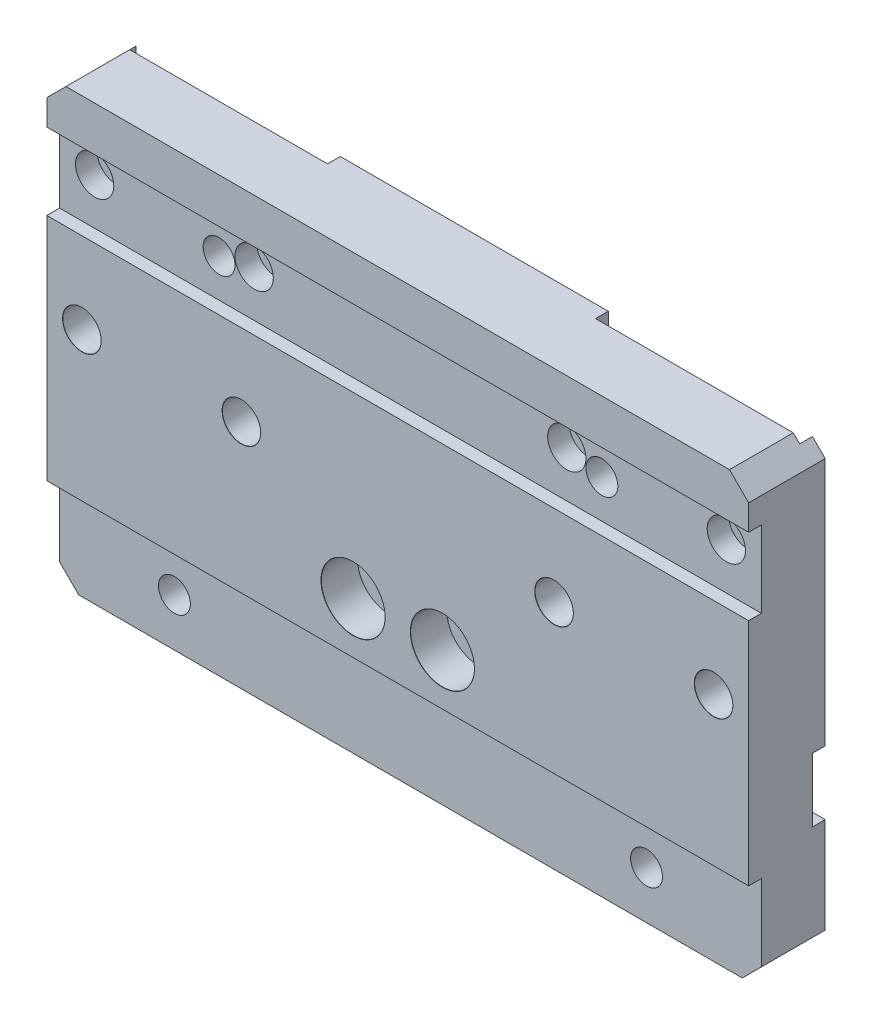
ISO-10303-21;
HEADER;
FILE_DESCRIPTION(('STEP AP214'),'2;1');
FILE_NAME('part.step','',(''),(''),'','','');
FILE_SCHEMA(('AUTOMOTIVE_DESIGN { 1 0 10303 214 1 1 1 1 }'));
ENDSEC;
DATA;
#1=APPLICATION_CONTEXT('core data for automotive mechanical design processes');
#2=APPLICATION_PROTOCOL_DEFINITION('international standard','automotive_design',2000,#1);
#3=PRODUCT_CONTEXT('',#1,'mechanical');
#4=PRODUCT('Part','Part','',(#3));
#5=PRODUCT_RELATED_PRODUCT_CATEGORY('part','',(#4));
#6=PRODUCT_DEFINITION_FORMATION('','',#4);
#7=PRODUCT_DEFINITION_CONTEXT('part definition',#1,'design');
#8=PRODUCT_DEFINITION('design','',#6,#7);
#9=PRODUCT_DEFINITION_SHAPE('','',#8);
#10=(LENGTH_UNIT() NAMED_UNIT(*) SI_UNIT(.MILLI.,.METRE.));
#11=(NAMED_UNIT(*) PLANE_ANGLE_UNIT() SI_UNIT($,.RADIAN.));
#12=(NAMED_UNIT(*) SI_UNIT($,.STERADIAN.) SOLID_ANGLE_UNIT());
#13=UNCERTAINTY_MEASURE_WITH_UNIT(LENGTH_MEASURE(1.E-05),#10,'distance_accuracy_value','');
#14=(GEOMETRIC_REPRESENTATION_CONTEXT(3) GLOBAL_UNCERTAINTY_ASSIGNED_CONTEXT((#13)) GLOBAL_UNIT_ASSIGNED_CONTEXT((#10,
#11,#12)) REPRESENTATION_CONTEXT('',''));
#15=CARTESIAN_POINT('',(0.,0.,0.));
#16=DIRECTION('',(0.,0.,1.));
#17=DIRECTION('',(1.,0.,0.));
#18=AXIS2_PLACEMENT_3D('',#15,#16,#17);
#19=CARTESIAN_POINT('',(0.,0.,0.));
#20=DIRECTION('',(0.,0.,1.));
#21=DIRECTION('',(1.,0.,0.));
#22=AXIS2_PLACEMENT_3D('',#19,#20,#21);
#23=PLANE('',#22);
#24=DIRECTION('',(1.,0.,0.));
#25=VECTOR('',#24,1.);
#26=CARTESIAN_POINT('',(-82.836216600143,-56.0960382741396,0.));
#27=LINE('',#26,#25);
#28=CARTESIAN_POINT('',(-48.836216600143,-56.0960382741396,0.));
#29=VERTEX_POINT('',#28);
#30=CARTESIAN_POINT('',(-6.83621660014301,-56.0960382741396,0.));
#31=VERTEX_POINT('',#30);
#32=EDGE_CURVE('E489',#29,#31,#27,.T.);
#33=ORIENTED_EDGE('',*,*,#32,.F.);
#34=DIRECTION('',(0.,1.,0.));
#35=VECTOR('',#34,1.);
#36=CARTESIAN_POINT('',(-48.836216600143,-56.0960382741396,0.));
#37=LINE('',#36,#35);
#38=CARTESIAN_POINT('',(-48.836216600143,-38.0960382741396,0.));
#39=VERTEX_POINT('',#38);
#40=EDGE_CURVE('E263',#29,#39,#37,.T.);
#41=ORIENTED_EDGE('',*,*,#40,.T.);
#42=DIRECTION('',(1.,0.,0.));
#43=VECTOR('',#42,1.);
#44=CARTESIAN_POINT('',(-82.836216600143,-38.0960382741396,0.));
#45=LINE('',#44,#43);
#46=CARTESIAN_POINT('',(-6.83621660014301,-38.0960382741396,0.));
#47=VERTEX_POINT('',#46);
#48=EDGE_CURVE('E408',#39,#47,#45,.T.);
#49=ORIENTED_EDGE('',*,*,#48,.T.);
#50=DIRECTION('',(0.,1.,0.));
#51=VECTOR('',#50,1.);
#52=CARTESIAN_POINT('',(-6.83621660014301,-56.0960382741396,0.));
#53=LINE('',#52,#51);
#54=EDGE_CURVE('E315',#31,#47,#53,.T.);
#55=ORIENTED_EDGE('',*,*,#54,.F.);
#56=EDGE_LOOP('',(#33,#41,#49,#55));
#57=FACE_BOUND('',#56,.T.);
#58=ADVANCED_FACE('F16',(#57),#23,.F.);
#59=DIRECTION('',(1.,0.,0.));
#60=VECTOR('',#59,1.);
#61=CARTESIAN_POINT('',(-82.836216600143,-28.0960382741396,0.));
#62=LINE('',#61,#60);
#63=CARTESIAN_POINT('',(-48.8362166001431,-28.0960382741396,0.));
#64=VERTEX_POINT('',#63);
#65=CARTESIAN_POINT('',(-6.83621660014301,-28.0960382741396,0.));
#66=VERTEX_POINT('',#65);
#67=EDGE_CURVE('E422',#64,#66,#62,.T.);
#68=ORIENTED_EDGE('',*,*,#67,.F.);
#69=CARTESIAN_POINT('',(-48.8362166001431,13.9039617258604,0.));
#70=VERTEX_POINT('',#69);
#71=EDGE_CURVE('E258',#64,#70,#37,.T.);
#72=ORIENTED_EDGE('',*,*,#71,.T.);
#73=DIRECTION('',(1.,0.,0.));
#74=VECTOR('',#73,1.);
#75=CARTESIAN_POINT('',(-82.8362166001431,13.9039617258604,0.));
#76=LINE('',#75,#74);
#77=CARTESIAN_POINT('',(-6.83621660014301,13.9039617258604,0.));
#78=VERTEX_POINT('',#77);
#79=EDGE_CURVE('E339',#70,#78,#76,.T.);
#80=ORIENTED_EDGE('',*,*,#79,.T.);
#81=EDGE_CURVE('E318',#66,#78,#53,.T.);
#82=ORIENTED_EDGE('',*,*,#81,.F.);
#83=EDGE_LOOP('',(#68,#72,#80,#82));
#84=FACE_BOUND('',#83,.T.);
#85=ADVANCED_FACE('F596',(#84),#23,.F.);
#86=CARTESIAN_POINT('',(-82.836216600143,-38.0960382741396,0.));
#87=DIRECTION('',(0.,-1.,0.));
#88=DIRECTION('',(1.,0.,0.));
#89=AXIS2_PLACEMENT_3D('',#86,#87,#88);
#90=PLANE('',#89);
#91=ORIENTED_EDGE('',*,*,#48,.F.);
#92=DIRECTION('',(0.,0.,1.));
#93=VECTOR('',#92,1.);
#94=CARTESIAN_POINT('',(-48.836216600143,-38.0960382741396,0.));
#95=LINE('',#94,#93);
#96=CARTESIAN_POINT('',(-48.836216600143,-38.0960382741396,2.));
#97=VERTEX_POINT('',#96);
#98=EDGE_CURVE('E293',#39,#97,#95,.T.);
#99=ORIENTED_EDGE('',*,*,#98,.T.);
#100=DIRECTION('',(1.,0.,0.));
#101=VECTOR('',#100,1.);
#102=CARTESIAN_POINT('',(-82.836216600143,-38.0960382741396,2.));
#103=LINE('',#102,#101);
#104=CARTESIAN_POINT('',(-6.83621660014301,-38.0960382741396,2.));
#105=VERTEX_POINT('',#104);
#106=EDGE_CURVE('E255',#97,#105,#103,.T.);
#107=ORIENTED_EDGE('',*,*,#106,.T.);
#108=DIRECTION('',(0.,0.,-1.));
#109=VECTOR('',#108,1.);
#110=CARTESIAN_POINT('',(-6.83621660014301,-38.0960382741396,0.));
#111=LINE('',#110,#109);
#112=EDGE_CURVE('E323',#105,#47,#111,.T.);
#113=ORIENTED_EDGE('',*,*,#112,.T.);
#114=EDGE_LOOP('',(#91,#99,#107,#113));
#115=FACE_BOUND('',#114,.T.);
#116=ADVANCED_FACE('F619',(#115),#90,.F.);
#117=CARTESIAN_POINT('',(-82.836216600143,-28.0960382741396,0.));
#118=DIRECTION('',(0.,1.,0.));
#119=DIRECTION('',(-1.,0.,0.));
#120=AXIS2_PLACEMENT_3D('',#117,#118,#119);
#121=PLANE('',#120);
#122=DIRECTION('',(1.,0.,0.));
#123=VECTOR('',#122,1.);
#124=CARTESIAN_POINT('',(-82.836216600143,-28.0960382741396,2.));
#125=LINE('',#124,#123);
#126=CARTESIAN_POINT('',(-48.8362166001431,-28.0960382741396,2.));
#127=VERTEX_POINT('',#126);
#128=CARTESIAN_POINT('',(-6.83621660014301,-28.0960382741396,2.));
#129=VERTEX_POINT('',#128);
#130=EDGE_CURVE('E417',#127,#129,#125,.T.);
#131=ORIENTED_EDGE('',*,*,#130,.F.);
#132=DIRECTION('',(0.,0.,-1.));
#133=VECTOR('',#132,1.);
#134=CARTESIAN_POINT('',(-48.8362166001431,-28.0960382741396,0.));
#135=LINE('',#134,#133);
#136=EDGE_CURVE('E290',#127,#64,#135,.T.);
#137=ORIENTED_EDGE('',*,*,#136,.T.);
#138=ORIENTED_EDGE('',*,*,#67,.T.);
#139=DIRECTION('',(0.,0.,1.));
#140=VECTOR('',#139,1.);
#141=CARTESIAN_POINT('',(-6.83621660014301,-28.0960382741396,0.));
#142=LINE('',#141,#140);
#143=EDGE_CURVE('E310',#66,#129,#142,.T.);
#144=ORIENTED_EDGE('',*,*,#143,.T.);
#145=EDGE_LOOP('',(#131,#137,#138,#144));
#146=FACE_BOUND('',#145,.T.);
#147=ADVANCED_FACE('F587',(#146),#121,.F.);
#148=DIRECTION('',(0.,1.,0.));
#149=VECTOR('',#148,1.);
#150=CARTESIAN_POINT('',(27.163783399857,43.9039617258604,0.));
#151=LINE('',#150,#149);
#152=CARTESIAN_POINT('',(27.163783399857,-53.0960382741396,0.));
#153=VERTEX_POINT('',#152);
#154=CARTESIAN_POINT('',(27.163783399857,-38.0960382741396,0.));
#155=VERTEX_POINT('',#154);
#156=EDGE_CURVE('E492',#153,#155,#151,.T.);
#157=ORIENTED_EDGE('',*,*,#156,.F.);
#158=DIRECTION('',(0.707106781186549,0.707106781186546,0.));
#159=VECTOR('',#158,1.);
#160=CARTESIAN_POINT('',(27.163783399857,-53.0960382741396,0.));
#161=LINE('',#160,#159);
#162=CARTESIAN_POINT('',(25.163783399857,-55.0960382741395,0.));
#163=VERTEX_POINT('',#162);
#164=EDGE_CURVE('E540',#153,#163,#161,.F.);
#165=ORIENTED_EDGE('',*,*,#164,.T.);
#166=DIRECTION('',(0.,1.,0.));
#167=VECTOR('',#166,1.);
#168=CARTESIAN_POINT('',(25.163783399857,-56.0960382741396,0.));
#169=LINE('',#168,#167);
#170=CARTESIAN_POINT('',(25.163783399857,-38.0960382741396,0.));
#171=VERTEX_POINT('',#170);
#172=EDGE_CURVE('E319',#163,#171,#169,.T.);
#173=ORIENTED_EDGE('',*,*,#172,.T.);
#174=EDGE_CURVE('E409',#171,#155,#45,.T.);
#175=ORIENTED_EDGE('',*,*,#174,.T.);
#176=EDGE_LOOP('',(#157,#165,#173,#175));
#177=FACE_BOUND('',#176,.T.);
#178=ADVANCED_FACE('F629',(#177),#23,.F.);
#179=CARTESIAN_POINT('',(25.163783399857,-28.0960382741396,0.));
#180=VERTEX_POINT('',#179);
#181=CARTESIAN_POINT('',(25.163783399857,12.9039617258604,0.));
#182=VERTEX_POINT('',#181);
#183=EDGE_CURVE('E303',#180,#182,#169,.T.);
#184=ORIENTED_EDGE('',*,*,#183,.T.);
#185=DIRECTION('',(-0.707106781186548,0.707106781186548,0.));
#186=VECTOR('',#185,1.);
#187=CARTESIAN_POINT('',(24.1637833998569,13.9039617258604,0.));
#188=LINE('',#187,#186);
#189=CARTESIAN_POINT('',(27.163783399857,10.9039617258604,0.));
#190=VERTEX_POINT('',#189);
#191=EDGE_CURVE('E550',#182,#190,#188,.F.);
#192=ORIENTED_EDGE('',*,*,#191,.T.);
#193=CARTESIAN_POINT('',(27.163783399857,-28.0960382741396,0.));
#194=VERTEX_POINT('',#193);
#195=EDGE_CURVE('E491',#194,#190,#151,.T.);
#196=ORIENTED_EDGE('',*,*,#195,.F.);
#197=EDGE_CURVE('E396',#180,#194,#62,.T.);
#198=ORIENTED_EDGE('',*,*,#197,.F.);
#199=EDGE_LOOP('',(#184,#192,#196,#198));
#200=FACE_BOUND('',#199,.T.);
#201=ADVANCED_FACE('F581',(#200),#23,.F.);
#202=ORIENTED_EDGE('',*,*,#174,.F.);
#203=DIRECTION('',(0.,0.,1.));
#204=VECTOR('',#203,1.);
#205=CARTESIAN_POINT('',(25.163783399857,-38.0960382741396,0.));
#206=LINE('',#205,#204);
#207=CARTESIAN_POINT('',(25.163783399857,-38.0960382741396,2.));
#208=VERTEX_POINT('',#207);
#209=EDGE_CURVE('E335',#171,#208,#206,.T.);
#210=ORIENTED_EDGE('',*,*,#209,.T.);
#211=CARTESIAN_POINT('',(27.163783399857,-38.0960382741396,2.));
#212=VERTEX_POINT('',#211);
#213=EDGE_CURVE('E413',#208,#212,#103,.T.);
#214=ORIENTED_EDGE('',*,*,#213,.T.);
#215=DIRECTION('',(0.,0.,-1.));
#216=VECTOR('',#215,1.);
#217=CARTESIAN_POINT('',(27.163783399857,-38.0960382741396,0.));
#218=LINE('',#217,#216);
#219=EDGE_CURVE('E390',#212,#155,#218,.T.);
#220=ORIENTED_EDGE('',*,*,#219,.T.);
#221=EDGE_LOOP('',(#202,#210,#214,#220));
#222=FACE_BOUND('',#221,.T.);
#223=ADVANCED_FACE('F613',(#222),#90,.F.);
#224=CARTESIAN_POINT('',(25.163783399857,-28.0960382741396,2.));
#225=VERTEX_POINT('',#224);
#226=CARTESIAN_POINT('',(27.163783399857,-28.0960382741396,2.));
#227=VERTEX_POINT('',#226);
#228=EDGE_CURVE('E418',#225,#227,#125,.T.);
#229=ORIENTED_EDGE('',*,*,#228,.F.);
#230=DIRECTION('',(0.,0.,-1.));
#231=VECTOR('',#230,1.);
#232=CARTESIAN_POINT('',(25.163783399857,-28.0960382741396,0.));
#233=LINE('',#232,#231);
#234=EDGE_CURVE('E332',#225,#180,#233,.T.);
#235=ORIENTED_EDGE('',*,*,#234,.T.);
#236=ORIENTED_EDGE('',*,*,#197,.T.);
#237=DIRECTION('',(0.,0.,1.));
#238=VECTOR('',#237,1.);
#239=CARTESIAN_POINT('',(27.163783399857,-28.0960382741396,0.));
#240=LINE('',#239,#238);
#241=EDGE_CURVE('E385',#194,#227,#240,.T.);
#242=ORIENTED_EDGE('',*,*,#241,.T.);
#243=EDGE_LOOP('',(#229,#235,#236,#242));
#244=FACE_BOUND('',#243,.T.);
#245=ADVANCED_FACE('F577',(#244),#121,.F.);
#246=DIRECTION('',(0.,1.,0.));
#247=VECTOR('',#246,1.);
#248=CARTESIAN_POINT('',(-80.836216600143,-56.0960382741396,0.));
#249=LINE('',#248,#247);
#250=CARTESIAN_POINT('',(-80.836216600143,-55.0960382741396,0.));
#251=VERTEX_POINT('',#250);
#252=CARTESIAN_POINT('',(-80.836216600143,-38.0960382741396,0.));
#253=VERTEX_POINT('',#252);
#254=EDGE_CURVE('E266',#251,#253,#249,.T.);
#255=ORIENTED_EDGE('',*,*,#254,.F.);
#256=DIRECTION('',(0.707106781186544,-0.707106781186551,0.));
#257=VECTOR('',#256,1.);
#258=CARTESIAN_POINT('',(-79.836216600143,-56.0960382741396,0.));
#259=LINE('',#258,#257);
#260=CARTESIAN_POINT('',(-82.836216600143,-53.0960382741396,0.));
#261=VERTEX_POINT('',#260);
#262=EDGE_CURVE('E524',#251,#261,#259,.F.);
#263=ORIENTED_EDGE('',*,*,#262,.T.);
#264=DIRECTION('',(0.,-1.,0.));
#265=VECTOR('',#264,1.);
#266=CARTESIAN_POINT('',(-82.836216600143,43.9039617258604,0.));
#267=LINE('',#266,#265);
#268=CARTESIAN_POINT('',(-82.836216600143,-38.0960382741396,0.));
#269=VERTEX_POINT('',#268);
#270=EDGE_CURVE('E473',#269,#261,#267,.T.);
#271=ORIENTED_EDGE('',*,*,#270,.F.);
#272=EDGE_CURVE('E404',#269,#253,#45,.T.);
#273=ORIENTED_EDGE('',*,*,#272,.T.);
#274=EDGE_LOOP('',(#255,#263,#271,#273));
#275=FACE_BOUND('',#274,.T.);
#276=ADVANCED_FACE('F707',(#275),#23,.F.);
#277=CARTESIAN_POINT('',(0.,0.,12.));
#278=DIRECTION('',(0.,0.,1.));
#279=DIRECTION('',(1.,0.,0.));
#280=AXIS2_PLACEMENT_3D('',#277,#278,#279);
#281=PLANE('',#280);
#282=DIRECTION('',(0.,1.,0.));
#283=VECTOR('',#282,1.);
#284=CARTESIAN_POINT('',(27.163783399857,43.9039617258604,12.));
#285=LINE('',#284,#283);
#286=CARTESIAN_POINT('',(27.163783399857,6.90396172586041,12.));
#287=VERTEX_POINT('',#286);
#288=CARTESIAN_POINT('',(27.163783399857,10.9039617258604,12.));
#289=VERTEX_POINT('',#288);
#290=EDGE_CURVE('E481',#287,#289,#285,.T.);
#291=ORIENTED_EDGE('',*,*,#290,.T.);
#292=DIRECTION('',(0.707106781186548,-0.707106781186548,0.));
#293=VECTOR('',#292,1.);
#294=CARTESIAN_POINT('',(19.0338725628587,19.0338725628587,12.));
#295=LINE('',#294,#293);
#296=CARTESIAN_POINT('',(24.1637833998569,13.9039617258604,12.));
#297=VERTEX_POINT('',#296);
#298=EDGE_CURVE('E554',#289,#297,#295,.F.);
#299=ORIENTED_EDGE('',*,*,#298,.T.);
#300=DIRECTION('',(1.,0.,0.));
#301=VECTOR('',#300,1.);
#302=CARTESIAN_POINT('',(-82.8362166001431,13.9039617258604,12.));
#303=LINE('',#302,#301);
#304=CARTESIAN_POINT('',(-79.8362166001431,13.9039617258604,12.));
#305=VERTEX_POINT('',#304);
#306=EDGE_CURVE('E338',#305,#297,#303,.T.);
#307=ORIENTED_EDGE('',*,*,#306,.F.);
#308=DIRECTION('',(0.707106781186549,0.707106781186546,0.));
#309=VECTOR('',#308,1.);
#310=CARTESIAN_POINT('',(-46.8700891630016,46.8700891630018,12.));
#311=LINE('',#310,#309);
#312=CARTESIAN_POINT('',(-82.836216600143,10.9039617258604,12.));
#313=VERTEX_POINT('',#312);
#314=EDGE_CURVE('E552',#305,#313,#311,.F.);
#315=ORIENTED_EDGE('',*,*,#314,.T.);
#316=DIRECTION('',(0.,-1.,0.));
#317=VECTOR('',#316,1.);
#318=CARTESIAN_POINT('',(-82.836216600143,43.9039617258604,12.));
#319=LINE('',#318,#317);
#320=CARTESIAN_POINT('',(-82.836216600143,6.90396172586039,12.));
#321=VERTEX_POINT('',#320);
#322=EDGE_CURVE('E479',#313,#321,#319,.T.);
#323=ORIENTED_EDGE('',*,*,#322,.T.);
#324=DIRECTION('',(1.,0.,0.));
#325=VECTOR('',#324,1.);
#326=CARTESIAN_POINT('',(-82.836216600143,6.90396172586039,12.));
#327=LINE('',#326,#325);
#328=EDGE_CURVE('E446',#321,#287,#327,.T.);
#329=ORIENTED_EDGE('',*,*,#328,.T.);
#330=EDGE_LOOP('',(#291,#299,#307,#315,#323,#329));
#331=FACE_BOUND('',#330,.T.);
#332=ADVANCED_FACE('F559',(#331),#281,.T.);
#333=CARTESIAN_POINT('',(-82.836216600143,43.9039617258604,12.));
#334=DIRECTION('',(1.,0.,0.));
#335=DIRECTION('',(0.,0.,-1.));
#336=AXIS2_PLACEMENT_3D('',#333,#334,#335);
#337=PLANE('',#336);
#338=ORIENTED_EDGE('',*,*,#270,.T.);
#339=DIRECTION('',(0.,0.,1.));
#340=VECTOR('',#339,1.);
#341=CARTESIAN_POINT('',(-82.836216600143,-53.0960382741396,12.));
#342=LINE('',#341,#340);
#343=CARTESIAN_POINT('',(-82.836216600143,-53.0960382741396,10.));
#344=VERTEX_POINT('',#343);
#345=EDGE_CURVE('E529',#261,#344,#342,.T.);
#346=ORIENTED_EDGE('',*,*,#345,.T.);
#347=DIRECTION('',(0.,1.,0.));
#348=VECTOR('',#347,1.);
#349=CARTESIAN_POINT('',(-82.836216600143,-56.0960382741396,10.));
#350=LINE('',#349,#348);
#351=CARTESIAN_POINT('',(-82.836216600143,-41.0960382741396,10.));
#352=VERTEX_POINT('',#351);
#353=EDGE_CURVE('E461',#344,#352,#350,.T.);
#354=ORIENTED_EDGE('',*,*,#353,.T.);
#355=DIRECTION('',(0.,0.,1.));
#356=VECTOR('',#355,1.);
#357=CARTESIAN_POINT('',(-82.836216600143,-41.0960382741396,12.));
#358=LINE('',#357,#356);
#359=CARTESIAN_POINT('',(-82.836216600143,-41.0960382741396,12.));
#360=VERTEX_POINT('',#359);
#361=EDGE_CURVE('E463',#352,#360,#358,.T.);
#362=ORIENTED_EDGE('',*,*,#361,.T.);
#363=CARTESIAN_POINT('',(-82.836216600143,-5.09603827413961,12.));
#364=VERTEX_POINT('',#363);
#365=EDGE_CURVE('E482',#364,#360,#319,.T.);
#366=ORIENTED_EDGE('',*,*,#365,.F.);
#367=DIRECTION('',(0.,0.,-1.));
#368=VECTOR('',#367,1.);
#369=CARTESIAN_POINT('',(-82.836216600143,-5.09603827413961,12.));
#370=LINE('',#369,#368);
#371=CARTESIAN_POINT('',(-82.836216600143,-5.09603827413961,10.));
#372=VERTEX_POINT('',#371);
#373=EDGE_CURVE('E429',#364,#372,#370,.T.);
#374=ORIENTED_EDGE('',*,*,#373,.T.);
#375=DIRECTION('',(0.,1.,0.));
#376=VECTOR('',#375,1.);
#377=CARTESIAN_POINT('',(-82.836216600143,6.90396172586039,10.));
#378=LINE('',#377,#376);
#379=CARTESIAN_POINT('',(-82.836216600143,6.90396172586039,10.));
#380=VERTEX_POINT('',#379);
#381=EDGE_CURVE('E432',#372,#380,#378,.T.);
#382=ORIENTED_EDGE('',*,*,#381,.T.);
#383=DIRECTION('',(0.,0.,1.));
#384=VECTOR('',#383,1.);
#385=CARTESIAN_POINT('',(-82.836216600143,6.90396172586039,12.));
#386=LINE('',#385,#384);
#387=EDGE_CURVE('E436',#380,#321,#386,.T.);
#388=ORIENTED_EDGE('',*,*,#387,.T.);
#389=ORIENTED_EDGE('',*,*,#322,.F.);
#390=DIRECTION('',(0.,0.,-1.));
#391=VECTOR('',#390,1.);
#392=CARTESIAN_POINT('',(-82.836216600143,10.9039617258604,12.));
#393=LINE('',#392,#391);
#394=CARTESIAN_POINT('',(-82.836216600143,10.9039617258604,0.));
#395=VERTEX_POINT('',#394);
#396=EDGE_CURVE('E526',#313,#395,#393,.T.);
#397=ORIENTED_EDGE('',*,*,#396,.T.);
#398=CARTESIAN_POINT('',(-82.836216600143,-28.0960382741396,0.));
#399=VERTEX_POINT('',#398);
#400=EDGE_CURVE('E487',#395,#399,#267,.T.);
#401=ORIENTED_EDGE('',*,*,#400,.T.);
#402=DIRECTION('',(0.,0.,1.));
#403=VECTOR('',#402,1.);
#404=CARTESIAN_POINT('',(-82.836216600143,-28.0960382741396,0.));
#405=LINE('',#404,#403);
#406=CARTESIAN_POINT('',(-82.836216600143,-28.0960382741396,2.));
#407=VERTEX_POINT('',#406);
#408=EDGE_CURVE('E386',#399,#407,#405,.T.);
#409=ORIENTED_EDGE('',*,*,#408,.T.);
#410=DIRECTION('',(0.,-1.,0.));
#411=VECTOR('',#410,1.);
#412=CARTESIAN_POINT('',(-82.836216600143,-38.0960382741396,2.));
#413=LINE('',#412,#411);
#414=CARTESIAN_POINT('',(-82.836216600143,-38.0960382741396,2.));
#415=VERTEX_POINT('',#414);
#416=EDGE_CURVE('E389',#407,#415,#413,.T.);
#417=ORIENTED_EDGE('',*,*,#416,.T.);
#418=DIRECTION('',(0.,0.,-1.));
#419=VECTOR('',#418,1.);
#420=CARTESIAN_POINT('',(-82.836216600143,-38.0960382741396,0.));
#421=LINE('',#420,#419);
#422=EDGE_CURVE('E393',#415,#269,#421,.T.);
#423=ORIENTED_EDGE('',*,*,#422,.T.);
#424=EDGE_LOOP('',(#338,#346,#354,#362,#366,#374,#382,#388,#389,#397,#401,#409,#417,#423));
#425=FACE_BOUND('',#424,.T.);
#426=ADVANCED_FACE('F661',(#425),#337,.F.);
#427=CARTESIAN_POINT('',(-82.836216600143,-56.0960382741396,12.));
#428=DIRECTION('',(0.,1.,0.));
#429=DIRECTION('',(0.,0.,1.));
#430=AXIS2_PLACEMENT_3D('',#427,#428,#429);
#431=PLANE('',#430);
#432=DIRECTION('',(1.,0.,0.));
#433=VECTOR('',#432,1.);
#434=CARTESIAN_POINT('',(-82.836216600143,-56.0960382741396,10.));
#435=LINE('',#434,#433);
#436=CARTESIAN_POINT('',(-79.836216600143,-56.0960382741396,10.));
#437=VERTEX_POINT('',#436);
#438=CARTESIAN_POINT('',(24.1637833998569,-56.0960382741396,10.));
#439=VERTEX_POINT('',#438);
#440=EDGE_CURVE('E467',#437,#439,#435,.T.);
#441=ORIENTED_EDGE('',*,*,#440,.F.);
#442=DIRECTION('',(0.,0.,-1.));
#443=VECTOR('',#442,1.);
#444=CARTESIAN_POINT('',(-79.836216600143,-56.0960382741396,12.));
#445=LINE('',#444,#443);
#446=CARTESIAN_POINT('',(-79.836216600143,-56.0960382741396,2.));
#447=VERTEX_POINT('',#446);
#448=EDGE_CURVE('E246',#437,#447,#445,.T.);
#449=ORIENTED_EDGE('',*,*,#448,.T.);
#450=DIRECTION('',(1.,0.,0.));
#451=VECTOR('',#450,1.);
#452=CARTESIAN_POINT('',(-80.836216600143,-56.0960382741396,2.));
#453=LINE('',#452,#451);
#454=CARTESIAN_POINT('',(-48.836216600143,-56.0960382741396,2.));
#455=VERTEX_POINT('',#454);
#456=EDGE_CURVE('E238',#447,#455,#453,.T.);
#457=ORIENTED_EDGE('',*,*,#456,.T.);
#458=DIRECTION('',(0.,0.,-1.));
#459=VECTOR('',#458,1.);
#460=CARTESIAN_POINT('',(-48.836216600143,-56.0960382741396,0.));
#461=LINE('',#460,#459);
#462=EDGE_CURVE('E243',#455,#29,#461,.T.);
#463=ORIENTED_EDGE('',*,*,#462,.T.);
#464=ORIENTED_EDGE('',*,*,#32,.T.);
#465=DIRECTION('',(0.,0.,1.));
#466=VECTOR('',#465,1.);
#467=CARTESIAN_POINT('',(-6.83621660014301,-56.0960382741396,0.));
#468=LINE('',#467,#466);
#469=CARTESIAN_POINT('',(-6.83621660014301,-56.0960382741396,2.));
#470=VERTEX_POINT('',#469);
#471=EDGE_CURVE('E296',#31,#470,#468,.T.);
#472=ORIENTED_EDGE('',*,*,#471,.T.);
#473=DIRECTION('',(1.,0.,0.));
#474=VECTOR('',#473,1.);
#475=CARTESIAN_POINT('',(25.163783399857,-56.0960382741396,2.));
#476=LINE('',#475,#474);
#477=CARTESIAN_POINT('',(24.1637833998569,-56.0960382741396,2.));
#478=VERTEX_POINT('',#477);
#479=EDGE_CURVE('E299',#470,#478,#476,.T.);
#480=ORIENTED_EDGE('',*,*,#479,.T.);
#481=DIRECTION('',(0.,0.,1.));
#482=VECTOR('',#481,1.);
#483=CARTESIAN_POINT('',(24.1637833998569,-56.0960382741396,12.));
#484=LINE('',#483,#482);
#485=EDGE_CURVE('E486',#478,#439,#484,.T.);
#486=ORIENTED_EDGE('',*,*,#485,.T.);
#487=EDGE_LOOP('',(#441,#449,#457,#463,#464,#472,#480,#486));
#488=FACE_BOUND('',#487,.T.);
#489=ADVANCED_FACE('F241',(#488),#431,.F.);
#490=CARTESIAN_POINT('',(27.163783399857,43.9039617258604,12.));
#491=DIRECTION('',(-1.,0.,0.));
#492=DIRECTION('',(0.,-1.,0.));
#493=AXIS2_PLACEMENT_3D('',#490,#491,#492);
#494=PLANE('',#493);
#495=DIRECTION('',(0.,1.,0.));
#496=VECTOR('',#495,1.);
#497=CARTESIAN_POINT('',(27.163783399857,-56.0960382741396,10.));
#498=LINE('',#497,#496);
#499=CARTESIAN_POINT('',(27.163783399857,-53.0960382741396,10.));
#500=VERTEX_POINT('',#499);
#501=CARTESIAN_POINT('',(27.163783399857,-41.0960382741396,10.));
#502=VERTEX_POINT('',#501);
#503=EDGE_CURVE('E460',#500,#502,#498,.T.);
#504=ORIENTED_EDGE('',*,*,#503,.F.);
#505=DIRECTION('',(0.,0.,-1.));
#506=VECTOR('',#505,1.);
#507=CARTESIAN_POINT('',(27.163783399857,-53.0960382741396,12.));
#508=LINE('',#507,#506);
#509=EDGE_CURVE('E537',#500,#153,#508,.T.);
#510=ORIENTED_EDGE('',*,*,#509,.T.);
#511=ORIENTED_EDGE('',*,*,#156,.T.);
#512=ORIENTED_EDGE('',*,*,#219,.F.);
#513=DIRECTION('',(0.,-1.,0.));
#514=VECTOR('',#513,1.);
#515=CARTESIAN_POINT('',(27.163783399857,-38.0960382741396,2.));
#516=LINE('',#515,#514);
#517=EDGE_CURVE('E399',#227,#212,#516,.T.);
#518=ORIENTED_EDGE('',*,*,#517,.F.);
#519=ORIENTED_EDGE('',*,*,#241,.F.);
#520=ORIENTED_EDGE('',*,*,#195,.T.);
#521=DIRECTION('',(0.,0.,1.));
#522=VECTOR('',#521,1.);
#523=CARTESIAN_POINT('',(27.163783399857,10.9039617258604,12.));
#524=LINE('',#523,#522);
#525=EDGE_CURVE('E535',#190,#289,#524,.T.);
#526=ORIENTED_EDGE('',*,*,#525,.T.);
#527=ORIENTED_EDGE('',*,*,#290,.F.);
#528=DIRECTION('',(0.,0.,1.));
#529=VECTOR('',#528,1.);
#530=CARTESIAN_POINT('',(27.163783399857,6.90396172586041,12.));
#531=LINE('',#530,#529);
#532=CARTESIAN_POINT('',(27.163783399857,6.90396172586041,10.));
#533=VERTEX_POINT('',#532);
#534=EDGE_CURVE('E433',#533,#287,#531,.T.);
#535=ORIENTED_EDGE('',*,*,#534,.F.);
#536=DIRECTION('',(0.,1.,0.));
#537=VECTOR('',#536,1.);
#538=CARTESIAN_POINT('',(27.163783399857,6.90396172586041,10.));
#539=LINE('',#538,#537);
#540=CARTESIAN_POINT('',(27.163783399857,-5.09603827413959,10.));
#541=VERTEX_POINT('',#540);
#542=EDGE_CURVE('E442',#541,#533,#539,.T.);
#543=ORIENTED_EDGE('',*,*,#542,.F.);
#544=DIRECTION('',(0.,0.,-1.));
#545=VECTOR('',#544,1.);
#546=CARTESIAN_POINT('',(27.163783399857,-5.09603827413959,12.));
#547=LINE('',#546,#545);
#548=CARTESIAN_POINT('',(27.163783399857,-5.09603827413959,12.));
#549=VERTEX_POINT('',#548);
#550=EDGE_CURVE('E428',#549,#541,#547,.T.);
#551=ORIENTED_EDGE('',*,*,#550,.F.);
#552=CARTESIAN_POINT('',(27.163783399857,-41.0960382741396,12.));
#553=VERTEX_POINT('',#552);
#554=EDGE_CURVE('E483',#553,#549,#285,.T.);
#555=ORIENTED_EDGE('',*,*,#554,.F.);
#556=DIRECTION('',(0.,0.,1.));
#557=VECTOR('',#556,1.);
#558=CARTESIAN_POINT('',(27.163783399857,-41.0960382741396,12.));
#559=LINE('',#558,#557);
#560=EDGE_CURVE('E464',#502,#553,#559,.T.);
#561=ORIENTED_EDGE('',*,*,#560,.F.);
#562=EDGE_LOOP('',(#504,#510,#511,#512,#518,#519,#520,#526,#527,#535,#543,#551,#555,#561));
#563=FACE_BOUND('',#562,.T.);
#564=ADVANCED_FACE('F608',(#563),#494,.F.);
#565=CARTESIAN_POINT('',(-52.336216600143,-17.8460382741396,12.));
#566=DIRECTION('',(0.,0.,1.));
#567=DIRECTION('',(1.,0.,0.));
#568=AXIS2_PLACEMENT_3D('',#565,#566,#567);
#569=CIRCLE('',#568,3.025);
#570=CARTESIAN_POINT('',(-49.311216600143,-17.8460382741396,12.));
#571=VERTEX_POINT('',#570);
#572=EDGE_CURVE('E1589',#571,#571,#569,.T.);
#573=ORIENTED_EDGE('',*,*,#572,.F.);
#574=EDGE_LOOP('',(#573));
#575=FACE_BOUND('',#574,.T.);
#576=CARTESIAN_POINT('',(-77.336216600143,-17.8460382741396,12.));
#577=DIRECTION('',(0.,0.,1.));
#578=DIRECTION('',(1.,0.,0.));
#579=AXIS2_PLACEMENT_3D('',#576,#577,#578);
#580=CIRCLE('',#579,3.025);
#581=CARTESIAN_POINT('',(-74.311216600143,-17.8460382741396,12.));
#582=VERTEX_POINT('',#581);
#583=EDGE_CURVE('E1593',#582,#582,#580,.T.);
#584=ORIENTED_EDGE('',*,*,#583,.F.);
#585=EDGE_LOOP('',(#584));
#586=FACE_BOUND('',#585,.T.);
#587=CARTESIAN_POINT('',(21.663783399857,-17.8460382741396,12.));
#588=DIRECTION('',(0.,0.,1.));
#589=DIRECTION('',(1.,0.,0.));
#590=AXIS2_PLACEMENT_3D('',#587,#588,#589);
#591=CIRCLE('',#590,3.025);
#592=CARTESIAN_POINT('',(24.688783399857,-17.8460382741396,12.));
#593=VERTEX_POINT('',#592);
#594=EDGE_CURVE('E1597',#593,#593,#591,.T.);
#595=ORIENTED_EDGE('',*,*,#594,.F.);
#596=EDGE_LOOP('',(#595));
#597=FACE_BOUND('',#596,.T.);
#598=CARTESIAN_POINT('',(-3.33621660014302,-17.8460382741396,12.));
#599=DIRECTION('',(0.,0.,1.));
#600=DIRECTION('',(1.,0.,0.));
#601=AXIS2_PLACEMENT_3D('',#598,#599,#600);
#602=CIRCLE('',#601,3.025);
#603=CARTESIAN_POINT('',(-0.311216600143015,-17.8460382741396,12.));
#604=VERTEX_POINT('',#603);
#605=EDGE_CURVE('E1601',#604,#604,#602,.T.);
#606=ORIENTED_EDGE('',*,*,#605,.F.);
#607=EDGE_LOOP('',(#606));
#608=FACE_BOUND('',#607,.T.);
#609=CARTESIAN_POINT('',(-34.836216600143,-33.0960382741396,12.));
#610=DIRECTION('',(0.,0.,1.));
#611=DIRECTION('',(1.,0.,0.));
#612=AXIS2_PLACEMENT_3D('',#609,#610,#611);
#613=CIRCLE('',#612,5.025);
#614=CARTESIAN_POINT('',(-29.811216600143,-33.0960382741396,12.));
#615=VERTEX_POINT('',#614);
#616=EDGE_CURVE('E346',#615,#615,#613,.T.);
#617=ORIENTED_EDGE('',*,*,#616,.F.);
#618=EDGE_LOOP('',(#617));
#619=FACE_BOUND('',#618,.T.);
#620=CARTESIAN_POINT('',(-20.836216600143,-33.0960382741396,12.));
#621=DIRECTION('',(0.,0.,1.));
#622=DIRECTION('',(1.,0.,0.));
#623=AXIS2_PLACEMENT_3D('',#620,#621,#622);
#624=CIRCLE('',#623,5.025);
#625=CARTESIAN_POINT('',(-15.811216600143,-33.0960382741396,12.));
#626=VERTEX_POINT('',#625);
#627=EDGE_CURVE('E367',#626,#626,#624,.T.);
#628=ORIENTED_EDGE('',*,*,#627,.F.);
#629=EDGE_LOOP('',(#628));
#630=FACE_BOUND('',#629,.T.);
#631=DIRECTION('',(1.,0.,0.));
#632=VECTOR('',#631,1.);
#633=CARTESIAN_POINT('',(-82.836216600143,-5.09603827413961,12.));
#634=LINE('',#633,#632);
#635=EDGE_CURVE('E439',#364,#549,#634,.T.);
#636=ORIENTED_EDGE('',*,*,#635,.F.);
#637=ORIENTED_EDGE('',*,*,#365,.T.);
#638=DIRECTION('',(1.,0.,0.));
#639=VECTOR('',#638,1.);
#640=CARTESIAN_POINT('',(-82.836216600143,-41.0960382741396,12.));
#641=LINE('',#640,#639);
#642=EDGE_CURVE('E470',#360,#553,#641,.T.);
#643=ORIENTED_EDGE('',*,*,#642,.T.);
#644=ORIENTED_EDGE('',*,*,#554,.T.);
#645=EDGE_LOOP('',(#636,#637,#643,#644));
#646=FACE_BOUND('',#645,.T.);
#647=ADVANCED_FACE('F689',(#575,#586,#597,#608,#619,#630,#646),#281,.T.);
#648=ORIENTED_EDGE('',*,*,#400,.F.);
#649=DIRECTION('',(-0.707106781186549,-0.707106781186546,0.));
#650=VECTOR('',#649,1.);
#651=CARTESIAN_POINT('',(-82.836216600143,10.9039617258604,0.));
#652=LINE('',#651,#650);
#653=CARTESIAN_POINT('',(-80.8362166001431,12.9039617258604,0.));
#654=VERTEX_POINT('',#653);
#655=EDGE_CURVE('E24',#395,#654,#652,.F.);
#656=ORIENTED_EDGE('',*,*,#655,.T.);
#657=CARTESIAN_POINT('',(-80.836216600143,-28.0960382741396,0.));
#658=VERTEX_POINT('',#657);
#659=EDGE_CURVE('E264',#658,#654,#249,.T.);
#660=ORIENTED_EDGE('',*,*,#659,.F.);
#661=EDGE_CURVE('E419',#399,#658,#62,.T.);
#662=ORIENTED_EDGE('',*,*,#661,.F.);
#663=EDGE_LOOP('',(#648,#656,#660,#662));
#664=FACE_BOUND('',#663,.T.);
#665=ADVANCED_FACE('F665',(#664),#23,.F.);
#666=CARTESIAN_POINT('',(-82.836216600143,-41.0960382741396,12.));
#667=DIRECTION('',(0.,1.,0.));
#668=DIRECTION('',(-1.,0.,0.));
#669=AXIS2_PLACEMENT_3D('',#666,#667,#668);
#670=PLANE('',#669);
#671=ORIENTED_EDGE('',*,*,#560,.T.);
#672=ORIENTED_EDGE('',*,*,#642,.F.);
#673=ORIENTED_EDGE('',*,*,#361,.F.);
#674=DIRECTION('',(1.,0.,0.));
#675=VECTOR('',#674,1.);
#676=CARTESIAN_POINT('',(-82.836216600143,-41.0960382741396,10.));
#677=LINE('',#676,#675);
#678=EDGE_CURVE('E474',#352,#502,#677,.T.);
#679=ORIENTED_EDGE('',*,*,#678,.T.);
#680=EDGE_LOOP('',(#671,#672,#673,#679));
#681=FACE_BOUND('',#680,.T.);
#682=ADVANCED_FACE('F693',(#681),#670,.F.);
#683=CARTESIAN_POINT('',(-82.836216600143,-56.0960382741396,10.));
#684=DIRECTION('',(0.,0.,-1.));
#685=DIRECTION('',(-1.,0.,0.));
#686=AXIS2_PLACEMENT_3D('',#683,#684,#685);
#687=PLANE('',#686);
#688=CARTESIAN_POINT('',(9.16378339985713,-48.5960382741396,10.));
#689=DIRECTION('',(0.,0.,1.));
#690=DIRECTION('',(1.,0.,0.));
#691=AXIS2_PLACEMENT_3D('',#688,#689,#690);
#692=CIRCLE('',#691,2.5);
#693=CARTESIAN_POINT('',(11.6637833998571,-48.5960382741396,10.));
#694=VERTEX_POINT('',#693);
#695=EDGE_CURVE('E449',#694,#694,#692,.T.);
#696=ORIENTED_EDGE('',*,*,#695,.F.);
#697=EDGE_LOOP('',(#696));
#698=FACE_BOUND('',#697,.T.);
#699=CARTESIAN_POINT('',(-64.8362166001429,-48.5960382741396,10.));
#700=DIRECTION('',(0.,0.,1.));
#701=DIRECTION('',(1.,0.,0.));
#702=AXIS2_PLACEMENT_3D('',#699,#700,#701);
#703=CIRCLE('',#702,2.5);
#704=CARTESIAN_POINT('',(-62.3362166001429,-48.5960382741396,10.));
#705=VERTEX_POINT('',#704);
#706=EDGE_CURVE('E457',#705,#705,#703,.T.);
#707=ORIENTED_EDGE('',*,*,#706,.F.);
#708=EDGE_LOOP('',(#707));
#709=FACE_BOUND('',#708,.T.);
#710=ORIENTED_EDGE('',*,*,#353,.F.);
#711=DIRECTION('',(-0.707106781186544,0.707106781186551,0.));
#712=VECTOR('',#711,1.);
#713=CARTESIAN_POINT('',(-79.836216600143,-56.0960382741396,10.));
#714=LINE('',#713,#712);
#715=EDGE_CURVE('E533',#344,#437,#714,.F.);
#716=ORIENTED_EDGE('',*,*,#715,.T.);
#717=ORIENTED_EDGE('',*,*,#440,.T.);
#718=DIRECTION('',(-0.707106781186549,-0.707106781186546,0.));
#719=VECTOR('',#718,1.);
#720=CARTESIAN_POINT('',(27.163783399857,-53.0960382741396,10.));
#721=LINE('',#720,#719);
#722=EDGE_CURVE('E531',#439,#500,#721,.F.);
#723=ORIENTED_EDGE('',*,*,#722,.T.);
#724=ORIENTED_EDGE('',*,*,#503,.T.);
#725=ORIENTED_EDGE('',*,*,#678,.F.);
#726=EDGE_LOOP('',(#710,#716,#717,#723,#724,#725));
#727=FACE_BOUND('',#726,.T.);
#728=ADVANCED_FACE('F640',(#698,#709,#727),#687,.F.);
#729=CARTESIAN_POINT('',(-64.8362166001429,-48.5960382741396,10.));
#730=DIRECTION('',(0.,0.,1.));
#731=DIRECTION('',(1.,0.,0.));
#732=AXIS2_PLACEMENT_3D('',#729,#730,#731);
#733=CYLINDRICAL_SURFACE('',#732,2.5);
#734=CARTESIAN_POINT('',(-64.8362166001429,-48.5960382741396,2.));
#735=DIRECTION('',(0.,0.,1.));
#736=DIRECTION('',(1.,0.,0.));
#737=AXIS2_PLACEMENT_3D('',#734,#735,#736);
#738=CIRCLE('',#737,2.5);
#739=CARTESIAN_POINT('',(-62.3362166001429,-48.5960382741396,2.));
#740=VERTEX_POINT('',#739);
#741=EDGE_CURVE('E287',#740,#740,#738,.F.);
#742=ORIENTED_EDGE('',*,*,#741,.T.);
#743=EDGE_LOOP('',(#742));
#744=FACE_BOUND('',#743,.T.);
#745=ORIENTED_EDGE('',*,*,#706,.T.);
#746=EDGE_LOOP('',(#745));
#747=FACE_BOUND('',#746,.T.);
#748=ADVANCED_FACE('F703',(#744,#747),#733,.F.);
#749=CARTESIAN_POINT('',(9.16378339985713,-48.5960382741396,10.));
#750=DIRECTION('',(0.,0.,1.));
#751=DIRECTION('',(1.,0.,0.));
#752=AXIS2_PLACEMENT_3D('',#749,#750,#751);
#753=CYLINDRICAL_SURFACE('',#752,2.5);
#754=CARTESIAN_POINT('',(9.16378339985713,-48.5960382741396,2.));
#755=DIRECTION('',(0.,0.,1.));
#756=DIRECTION('',(1.,0.,0.));
#757=AXIS2_PLACEMENT_3D('',#754,#755,#756);
#758=CIRCLE('',#757,2.5);
#759=CARTESIAN_POINT('',(11.6637833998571,-48.5960382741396,2.));
#760=VERTEX_POINT('',#759);
#761=EDGE_CURVE('E329',#760,#760,#758,.F.);
#762=ORIENTED_EDGE('',*,*,#761,.T.);
#763=EDGE_LOOP('',(#762));
#764=FACE_BOUND('',#763,.T.);
#765=ORIENTED_EDGE('',*,*,#695,.T.);
#766=EDGE_LOOP('',(#765));
#767=FACE_BOUND('',#766,.T.);
#768=ADVANCED_FACE('F1460',(#764,#767),#753,.F.);
#769=CARTESIAN_POINT('',(-82.836216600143,6.90396172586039,12.));
#770=DIRECTION('',(0.,1.,0.));
#771=DIRECTION('',(-1.,0.,0.));
#772=AXIS2_PLACEMENT_3D('',#769,#770,#771);
#773=PLANE('',#772);
#774=ORIENTED_EDGE('',*,*,#534,.T.);
#775=ORIENTED_EDGE('',*,*,#328,.F.);
#776=ORIENTED_EDGE('',*,*,#387,.F.);
#777=DIRECTION('',(1.,0.,0.));
#778=VECTOR('',#777,1.);
#779=CARTESIAN_POINT('',(-82.836216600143,6.90396172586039,10.));
#780=LINE('',#779,#778);
#781=EDGE_CURVE('E450',#380,#533,#780,.T.);
#782=ORIENTED_EDGE('',*,*,#781,.T.);
#783=EDGE_LOOP('',(#774,#775,#776,#782));
#784=FACE_BOUND('',#783,.T.);
#785=ADVANCED_FACE('F677',(#784),#773,.F.);
#786=CARTESIAN_POINT('',(-82.836216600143,6.90396172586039,10.));
#787=DIRECTION('',(0.,0.,-1.));
#788=DIRECTION('',(0.,1.,0.));
#789=AXIS2_PLACEMENT_3D('',#786,#787,#788);
#790=PLANE('',#789);
#791=CARTESIAN_POINT('',(-77.336216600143,2.15396172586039,10.));
#792=DIRECTION('',(0.,0.,-1.));
#793=DIRECTION('',(0.,1.,0.));
#794=AXIS2_PLACEMENT_3D('',#791,#792,#793);
#795=CIRCLE('',#794,3.);
#796=CARTESIAN_POINT('',(-77.336216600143,5.15396172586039,10.));
#797=VERTEX_POINT('',#796);
#798=EDGE_CURVE('E507',#797,#797,#795,.T.);
#799=ORIENTED_EDGE('',*,*,#798,.T.);
#800=EDGE_LOOP('',(#799));
#801=FACE_BOUND('',#800,.T.);
#802=CARTESIAN_POINT('',(-52.336216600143,2.15396172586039,10.));
#803=DIRECTION('',(0.,0.,-1.));
#804=DIRECTION('',(0.,1.,0.));
#805=AXIS2_PLACEMENT_3D('',#802,#803,#804);
#806=CIRCLE('',#805,3.);
#807=CARTESIAN_POINT('',(-52.336216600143,5.15396172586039,10.));
#808=VERTEX_POINT('',#807);
#809=EDGE_CURVE('E502',#808,#808,#806,.T.);
#810=ORIENTED_EDGE('',*,*,#809,.T.);
#811=EDGE_LOOP('',(#810));
#812=FACE_BOUND('',#811,.T.);
#813=CARTESIAN_POINT('',(-3.33621660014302,2.1539617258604,10.));
#814=DIRECTION('',(0.,0.,-1.));
#815=DIRECTION('',(0.,1.,0.));
#816=AXIS2_PLACEMENT_3D('',#813,#814,#815);
#817=CIRCLE('',#816,3.);
#818=CARTESIAN_POINT('',(-3.33621660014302,5.1539617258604,10.));
#819=VERTEX_POINT('',#818);
#820=EDGE_CURVE('E497',#819,#819,#817,.T.);
#821=ORIENTED_EDGE('',*,*,#820,.T.);
#822=EDGE_LOOP('',(#821));
#823=FACE_BOUND('',#822,.T.);
#824=CARTESIAN_POINT('',(21.663783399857,2.1539617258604,10.));
#825=DIRECTION('',(0.,0.,-1.));
#826=DIRECTION('',(0.,1.,0.));
#827=AXIS2_PLACEMENT_3D('',#824,#825,#826);
#828=CIRCLE('',#827,3.);
#829=CARTESIAN_POINT('',(21.663783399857,5.1539617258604,10.));
#830=VERTEX_POINT('',#829);
#831=EDGE_CURVE('E272',#830,#830,#828,.T.);
#832=ORIENTED_EDGE('',*,*,#831,.T.);
#833=EDGE_LOOP('',(#832));
#834=FACE_BOUND('',#833,.T.);
#835=CARTESIAN_POINT('',(2.16378339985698,0.903961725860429,10.));
#836=DIRECTION('',(0.,0.,1.));
#837=DIRECTION('',(1.,0.,0.));
#838=AXIS2_PLACEMENT_3D('',#835,#836,#837);
#839=CIRCLE('',#838,2.5);
#840=CARTESIAN_POINT('',(4.66378339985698,0.903961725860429,10.));
#841=VERTEX_POINT('',#840);
#842=EDGE_CURVE('E407',#841,#841,#839,.T.);
#843=ORIENTED_EDGE('',*,*,#842,.F.);
#844=EDGE_LOOP('',(#843));
#845=FACE_BOUND('',#844,.T.);
#846=CARTESIAN_POINT('',(-57.836216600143,0.903961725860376,10.));
#847=DIRECTION('',(0.,0.,1.));
#848=DIRECTION('',(1.,0.,0.));
#849=AXIS2_PLACEMENT_3D('',#846,#847,#848);
#850=CIRCLE('',#849,2.5);
#851=CARTESIAN_POINT('',(-55.336216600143,0.903961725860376,10.));
#852=VERTEX_POINT('',#851);
#853=EDGE_CURVE('E425',#852,#852,#850,.T.);
#854=ORIENTED_EDGE('',*,*,#853,.F.);
#855=EDGE_LOOP('',(#854));
#856=FACE_BOUND('',#855,.T.);
#857=ORIENTED_EDGE('',*,*,#542,.T.);
#858=ORIENTED_EDGE('',*,*,#781,.F.);
#859=ORIENTED_EDGE('',*,*,#381,.F.);
#860=DIRECTION('',(1.,0.,0.));
#861=VECTOR('',#860,1.);
#862=CARTESIAN_POINT('',(-82.836216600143,-5.09603827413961,10.));
#863=LINE('',#862,#861);
#864=EDGE_CURVE('E452',#372,#541,#863,.T.);
#865=ORIENTED_EDGE('',*,*,#864,.T.);
#866=EDGE_LOOP('',(#857,#858,#859,#865));
#867=FACE_BOUND('',#866,.T.);
#868=ADVANCED_FACE('F683',(#801,#812,#823,#834,#845,#856,#867),#790,.F.);
#869=CARTESIAN_POINT('',(-82.836216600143,-5.09603827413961,12.));
#870=DIRECTION('',(0.,-1.,0.));
#871=DIRECTION('',(1.,0.,0.));
#872=AXIS2_PLACEMENT_3D('',#869,#870,#871);
#873=PLANE('',#872);
#874=ORIENTED_EDGE('',*,*,#550,.T.);
#875=ORIENTED_EDGE('',*,*,#864,.F.);
#876=ORIENTED_EDGE('',*,*,#373,.F.);
#877=ORIENTED_EDGE('',*,*,#635,.T.);
#878=EDGE_LOOP('',(#874,#875,#876,#877));
#879=FACE_BOUND('',#878,.T.);
#880=ADVANCED_FACE('F685',(#879),#873,.F.);
#881=CARTESIAN_POINT('',(-57.836216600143,0.903961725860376,10.));
#882=DIRECTION('',(0.,0.,1.));
#883=DIRECTION('',(1.,0.,0.));
#884=AXIS2_PLACEMENT_3D('',#881,#882,#883);
#885=CYLINDRICAL_SURFACE('',#884,2.5);
#886=CARTESIAN_POINT('',(-57.836216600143,0.903961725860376,2.));
#887=DIRECTION('',(0.,0.,1.));
#888=DIRECTION('',(1.,0.,0.));
#889=AXIS2_PLACEMENT_3D('',#886,#887,#888);
#890=CIRCLE('',#889,2.5);
#891=CARTESIAN_POINT('',(-55.336216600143,0.903961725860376,2.));
#892=VERTEX_POINT('',#891);
#893=EDGE_CURVE('E284',#892,#892,#890,.F.);
#894=ORIENTED_EDGE('',*,*,#893,.T.);
#895=EDGE_LOOP('',(#894));
#896=FACE_BOUND('',#895,.T.);
#897=ORIENTED_EDGE('',*,*,#853,.T.);
#898=EDGE_LOOP('',(#897));
#899=FACE_BOUND('',#898,.T.);
#900=ADVANCED_FACE('F1422',(#896,#899),#885,.F.);
#901=CARTESIAN_POINT('',(2.16378339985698,0.903961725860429,10.));
#902=DIRECTION('',(0.,0.,1.));
#903=DIRECTION('',(1.,0.,0.));
#904=AXIS2_PLACEMENT_3D('',#901,#902,#903);
#905=CYLINDRICAL_SURFACE('',#904,2.5);
#906=CARTESIAN_POINT('',(2.16378339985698,0.903961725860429,2.));
#907=DIRECTION('',(0.,0.,1.));
#908=DIRECTION('',(1.,0.,0.));
#909=AXIS2_PLACEMENT_3D('',#906,#907,#908);
#910=CIRCLE('',#909,2.5);
#911=CARTESIAN_POINT('',(4.66378339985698,0.903961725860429,2.));
#912=VERTEX_POINT('',#911);
#913=EDGE_CURVE('E326',#912,#912,#910,.F.);
#914=ORIENTED_EDGE('',*,*,#913,.T.);
#915=EDGE_LOOP('',(#914));
#916=FACE_BOUND('',#915,.T.);
#917=ORIENTED_EDGE('',*,*,#842,.T.);
#918=EDGE_LOOP('',(#917));
#919=FACE_BOUND('',#918,.T.);
#920=ADVANCED_FACE('F1413',(#916,#919),#905,.F.);
#921=CARTESIAN_POINT('',(-80.836216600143,-38.0960382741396,2.));
#922=VERTEX_POINT('',#921);
#923=EDGE_CURVE('E410',#415,#922,#103,.T.);
#924=ORIENTED_EDGE('',*,*,#923,.T.);
#925=DIRECTION('',(0.,0.,-1.));
#926=VECTOR('',#925,1.);
#927=CARTESIAN_POINT('',(-80.836216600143,-38.0960382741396,0.));
#928=LINE('',#927,#926);
#929=EDGE_CURVE('E281',#922,#253,#928,.T.);
#930=ORIENTED_EDGE('',*,*,#929,.T.);
#931=ORIENTED_EDGE('',*,*,#272,.F.);
#932=ORIENTED_EDGE('',*,*,#422,.F.);
#933=EDGE_LOOP('',(#924,#930,#931,#932));
#934=FACE_BOUND('',#933,.T.);
#935=ADVANCED_FACE('F655',(#934),#90,.F.);
#936=CARTESIAN_POINT('',(-82.836216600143,-38.0960382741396,2.));
#937=DIRECTION('',(0.,0.,1.));
#938=DIRECTION('',(1.,0.,0.));
#939=AXIS2_PLACEMENT_3D('',#936,#937,#938);
#940=PLANE('',#939);
#941=CARTESIAN_POINT('',(-52.336216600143,-17.8460382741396,2.));
#942=DIRECTION('',(0.,0.,1.));
#943=DIRECTION('',(1.,0.,0.));
#944=AXIS2_PLACEMENT_3D('',#941,#942,#943);
#945=CIRCLE('',#944,1.725);
#946=CARTESIAN_POINT('',(-50.611216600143,-17.8460382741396,2.));
#947=VERTEX_POINT('',#946);
#948=EDGE_CURVE('E1776',#947,#947,#945,.T.);
#949=ORIENTED_EDGE('',*,*,#948,.T.);
#950=EDGE_LOOP('',(#949));
#951=FACE_BOUND('',#950,.T.);
#952=CARTESIAN_POINT('',(-77.336216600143,-17.8460382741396,2.));
#953=DIRECTION('',(0.,0.,1.));
#954=DIRECTION('',(1.,0.,0.));
#955=AXIS2_PLACEMENT_3D('',#952,#953,#954);
#956=CIRCLE('',#955,1.725);
#957=CARTESIAN_POINT('',(-75.611216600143,-17.8460382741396,2.));
#958=VERTEX_POINT('',#957);
#959=EDGE_CURVE('E1757',#958,#958,#956,.T.);
#960=ORIENTED_EDGE('',*,*,#959,.T.);
#961=EDGE_LOOP('',(#960));
#962=FACE_BOUND('',#961,.T.);
#963=CARTESIAN_POINT('',(-77.336216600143,2.15396172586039,2.));
#964=DIRECTION('',(0.,0.,1.));
#965=DIRECTION('',(1.,0.,0.));
#966=AXIS2_PLACEMENT_3D('',#963,#964,#965);
#967=CIRCLE('',#966,1.725);
#968=CARTESIAN_POINT('',(-75.611216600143,2.15396172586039,2.));
#969=VERTEX_POINT('',#968);
#970=EDGE_CURVE('E1738',#969,#969,#967,.T.);
#971=ORIENTED_EDGE('',*,*,#970,.T.);
#972=EDGE_LOOP('',(#971));
#973=FACE_BOUND('',#972,.T.);
#974=CARTESIAN_POINT('',(-52.336216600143,2.15396172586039,2.));
#975=DIRECTION('',(0.,0.,1.));
#976=DIRECTION('',(1.,0.,0.));
#977=AXIS2_PLACEMENT_3D('',#974,#975,#976);
#978=CIRCLE('',#977,1.725);
#979=CARTESIAN_POINT('',(-50.611216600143,2.15396172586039,2.));
#980=VERTEX_POINT('',#979);
#981=EDGE_CURVE('E510',#980,#980,#978,.T.);
#982=ORIENTED_EDGE('',*,*,#981,.T.);
#983=EDGE_LOOP('',(#982));
#984=FACE_BOUND('',#983,.T.);
#985=CARTESIAN_POINT('',(21.663783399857,-17.8460382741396,2.));
#986=DIRECTION('',(0.,0.,1.));
#987=DIRECTION('',(1.,0.,0.));
#988=AXIS2_PLACEMENT_3D('',#985,#986,#987);
#989=CIRCLE('',#988,1.725);
#990=CARTESIAN_POINT('',(23.388783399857,-17.8460382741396,2.));
#991=VERTEX_POINT('',#990);
#992=EDGE_CURVE('E505',#991,#991,#989,.T.);
#993=ORIENTED_EDGE('',*,*,#992,.T.);
#994=EDGE_LOOP('',(#993));
#995=FACE_BOUND('',#994,.T.);
#996=CARTESIAN_POINT('',(-3.33621660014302,-17.8460382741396,2.));
#997=DIRECTION('',(0.,0.,1.));
#998=DIRECTION('',(1.,0.,0.));
#999=AXIS2_PLACEMENT_3D('',#996,#997,#998);
#1000=CIRCLE('',#999,1.725);
#1001=CARTESIAN_POINT('',(-1.61121660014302,-17.8460382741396,2.));
#1002=VERTEX_POINT('',#1001);
#1003=EDGE_CURVE('E1609',#1002,#1002,#1000,.T.);
#1004=ORIENTED_EDGE('',*,*,#1003,.T.);
#1005=EDGE_LOOP('',(#1004));
#1006=FACE_BOUND('',#1005,.T.);
#1007=CARTESIAN_POINT('',(-3.33621660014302,2.1539617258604,2.));
#1008=DIRECTION('',(0.,0.,1.));
#1009=DIRECTION('',(1.,0.,0.));
#1010=AXIS2_PLACEMENT_3D('',#1007,#1008,#1009);
#1011=CIRCLE('',#1010,1.725);
#1012=CARTESIAN_POINT('',(-1.61121660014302,2.1539617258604,2.));
#1013=VERTEX_POINT('',#1012);
#1014=EDGE_CURVE('E1630',#1013,#1013,#1011,.T.);
#1015=ORIENTED_EDGE('',*,*,#1014,.T.);
#1016=EDGE_LOOP('',(#1015));
#1017=FACE_BOUND('',#1016,.T.);
#1018=CARTESIAN_POINT('',(21.663783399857,2.1539617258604,2.));
#1019=DIRECTION('',(0.,0.,1.));
#1020=DIRECTION('',(1.,0.,0.));
#1021=AXIS2_PLACEMENT_3D('',#1018,#1019,#1020);
#1022=CIRCLE('',#1021,1.725);
#1023=CARTESIAN_POINT('',(23.388783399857,2.1539617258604,2.));
#1024=VERTEX_POINT('',#1023);
#1025=EDGE_CURVE('E500',#1024,#1024,#1022,.T.);
#1026=ORIENTED_EDGE('',*,*,#1025,.T.);
#1027=EDGE_LOOP('',(#1026));
#1028=FACE_BOUND('',#1027,.T.);
#1029=ORIENTED_EDGE('',*,*,#456,.F.);
#1030=DIRECTION('',(0.707106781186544,-0.707106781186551,0.));
#1031=VECTOR('',#1030,1.);
#1032=CARTESIAN_POINT('',(-79.836216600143,-56.0960382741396,2.));
#1033=LINE('',#1032,#1031);
#1034=CARTESIAN_POINT('',(-80.836216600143,-55.0960382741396,2.));
#1035=VERTEX_POINT('',#1034);
#1036=EDGE_CURVE('E520',#447,#1035,#1033,.F.);
#1037=ORIENTED_EDGE('',*,*,#1036,.T.);
#1038=DIRECTION('',(0.,1.,0.));
#1039=VECTOR('',#1038,1.);
#1040=CARTESIAN_POINT('',(-80.836216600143,-56.0960382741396,2.));
#1041=LINE('',#1040,#1039);
#1042=EDGE_CURVE('E276',#1035,#922,#1041,.T.);
#1043=ORIENTED_EDGE('',*,*,#1042,.T.);
#1044=ORIENTED_EDGE('',*,*,#923,.F.);
#1045=ORIENTED_EDGE('',*,*,#416,.F.);
#1046=CARTESIAN_POINT('',(-80.836216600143,-28.0960382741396,2.));
#1047=VERTEX_POINT('',#1046);
#1048=EDGE_CURVE('E414',#407,#1047,#125,.T.);
#1049=ORIENTED_EDGE('',*,*,#1048,.T.);
#1050=CARTESIAN_POINT('',(-80.8362166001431,12.9039617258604,2.));
#1051=VERTEX_POINT('',#1050);
#1052=EDGE_CURVE('E277',#1047,#1051,#1041,.T.);
#1053=ORIENTED_EDGE('',*,*,#1052,.T.);
#1054=DIRECTION('',(-0.707106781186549,-0.707106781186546,0.));
#1055=VECTOR('',#1054,1.);
#1056=CARTESIAN_POINT('',(-82.836216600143,10.9039617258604,2.));
#1057=LINE('',#1056,#1055);
#1058=CARTESIAN_POINT('',(-79.836216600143,13.9039617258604,2.));
#1059=VERTEX_POINT('',#1058);
#1060=EDGE_CURVE('E514',#1051,#1059,#1057,.F.);
#1061=ORIENTED_EDGE('',*,*,#1060,.T.);
#1062=DIRECTION('',(1.,0.,0.));
#1063=VECTOR('',#1062,1.);
#1064=CARTESIAN_POINT('',(-80.8362166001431,13.9039617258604,2.));
#1065=LINE('',#1064,#1063);
#1066=CARTESIAN_POINT('',(-48.8362166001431,13.9039617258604,2.));
#1067=VERTEX_POINT('',#1066);
#1068=EDGE_CURVE('E270',#1059,#1067,#1065,.T.);
#1069=ORIENTED_EDGE('',*,*,#1068,.T.);
#1070=DIRECTION('',(0.,1.,0.));
#1071=VECTOR('',#1070,1.);
#1072=CARTESIAN_POINT('',(-48.836216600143,-56.0960382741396,2.));
#1073=LINE('',#1072,#1071);
#1074=EDGE_CURVE('E259',#127,#1067,#1073,.T.);
#1075=ORIENTED_EDGE('',*,*,#1074,.F.);
#1076=ORIENTED_EDGE('',*,*,#130,.T.);
#1077=DIRECTION('',(0.,1.,0.));
#1078=VECTOR('',#1077,1.);
#1079=CARTESIAN_POINT('',(-6.83621660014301,-56.0960382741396,2.));
#1080=LINE('',#1079,#1078);
#1081=CARTESIAN_POINT('',(-6.83621660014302,13.9039617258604,2.));
#1082=VERTEX_POINT('',#1081);
#1083=EDGE_CURVE('E314',#129,#1082,#1080,.T.);
#1084=ORIENTED_EDGE('',*,*,#1083,.T.);
#1085=DIRECTION('',(1.,0.,0.));
#1086=VECTOR('',#1085,1.);
#1087=CARTESIAN_POINT('',(25.163783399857,13.9039617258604,2.));
#1088=LINE('',#1087,#1086);
#1089=CARTESIAN_POINT('',(24.1637833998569,13.9039617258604,2.));
#1090=VERTEX_POINT('',#1089);
#1091=EDGE_CURVE('E300',#1082,#1090,#1088,.T.);
#1092=ORIENTED_EDGE('',*,*,#1091,.T.);
#1093=DIRECTION('',(-0.707106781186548,0.707106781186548,0.));
#1094=VECTOR('',#1093,1.);
#1095=CARTESIAN_POINT('',(24.1637833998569,13.9039617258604,2.));
#1096=LINE('',#1095,#1094);
#1097=CARTESIAN_POINT('',(25.163783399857,12.9039617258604,2.));
#1098=VERTEX_POINT('',#1097);
#1099=EDGE_CURVE('E516',#1090,#1098,#1096,.F.);
#1100=ORIENTED_EDGE('',*,*,#1099,.T.);
#1101=DIRECTION('',(0.,1.,0.));
#1102=VECTOR('',#1101,1.);
#1103=CARTESIAN_POINT('',(25.163783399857,-56.0960382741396,2.));
#1104=LINE('',#1103,#1102);
#1105=EDGE_CURVE('E311',#225,#1098,#1104,.T.);
#1106=ORIENTED_EDGE('',*,*,#1105,.F.);
#1107=ORIENTED_EDGE('',*,*,#228,.T.);
#1108=ORIENTED_EDGE('',*,*,#517,.T.);
#1109=ORIENTED_EDGE('',*,*,#213,.F.);
#1110=CARTESIAN_POINT('',(25.163783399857,-55.0960382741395,2.));
#1111=VERTEX_POINT('',#1110);
#1112=EDGE_CURVE('E308',#1111,#208,#1104,.T.);
#1113=ORIENTED_EDGE('',*,*,#1112,.F.);
#1114=DIRECTION('',(0.707106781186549,0.707106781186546,0.));
#1115=VECTOR('',#1114,1.);
#1116=CARTESIAN_POINT('',(27.163783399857,-53.0960382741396,2.));
#1117=LINE('',#1116,#1115);
#1118=EDGE_CURVE('E518',#1111,#478,#1117,.F.);
#1119=ORIENTED_EDGE('',*,*,#1118,.T.);
#1120=ORIENTED_EDGE('',*,*,#479,.F.);
#1121=EDGE_CURVE('E312',#470,#105,#1080,.T.);
#1122=ORIENTED_EDGE('',*,*,#1121,.T.);
#1123=ORIENTED_EDGE('',*,*,#106,.F.);
#1124=EDGE_CURVE('E251',#455,#97,#1073,.T.);
#1125=ORIENTED_EDGE('',*,*,#1124,.F.);
#1126=EDGE_LOOP('',(#1029,#1037,#1043,#1044,#1045,#1049,#1053,#1061,#1069,#1075,#1076,#1084,
#1092,#1100,#1106,#1107,#1108,#1109,#1113,#1119,#1120,#1122,#1123,#1125));
#1127=FACE_BOUND('',#1126,.T.);
#1128=ORIENTED_EDGE('',*,*,#893,.F.);
#1129=EDGE_LOOP('',(#1128));
#1130=FACE_BOUND('',#1129,.T.);
#1131=ORIENTED_EDGE('',*,*,#761,.F.);
#1132=EDGE_LOOP('',(#1131));
#1133=FACE_BOUND('',#1132,.T.);
#1134=ORIENTED_EDGE('',*,*,#913,.F.);
#1135=EDGE_LOOP('',(#1134));
#1136=FACE_BOUND('',#1135,.T.);
#1137=CARTESIAN_POINT('',(-20.836216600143,-33.0960382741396,2.));
#1138=DIRECTION('',(0.,0.,1.));
#1139=DIRECTION('',(1.,0.,0.));
#1140=AXIS2_PLACEMENT_3D('',#1137,#1138,#1139);
#1141=CIRCLE('',#1140,2.775);
#1142=CARTESIAN_POINT('',(-18.061216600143,-33.0960382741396,2.));
#1143=VERTEX_POINT('',#1142);
#1144=EDGE_CURVE('E364',#1143,#1143,#1141,.T.);
#1145=ORIENTED_EDGE('',*,*,#1144,.T.);
#1146=EDGE_LOOP('',(#1145));
#1147=FACE_BOUND('',#1146,.T.);
#1148=CARTESIAN_POINT('',(-34.836216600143,-33.0960382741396,2.));
#1149=DIRECTION('',(0.,0.,1.));
#1150=DIRECTION('',(1.,0.,0.));
#1151=AXIS2_PLACEMENT_3D('',#1148,#1149,#1150);
#1152=CIRCLE('',#1151,2.775);
#1153=CARTESIAN_POINT('',(-32.061216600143,-33.0960382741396,2.));
#1154=VERTEX_POINT('',#1153);
#1155=EDGE_CURVE('E341',#1154,#1154,#1152,.T.);
#1156=ORIENTED_EDGE('',*,*,#1155,.T.);
#1157=EDGE_LOOP('',(#1156));
#1158=FACE_BOUND('',#1157,.T.);
#1159=ORIENTED_EDGE('',*,*,#741,.F.);
#1160=EDGE_LOOP('',(#1159));
#1161=FACE_BOUND('',#1160,.T.);
#1162=ADVANCED_FACE('F252',(#951,#962,#973,#984,#995,#1006,#1017,#1028,#1127,#1130,#1133,#1136,
#1147,#1158,#1161),#940,.F.);
#1163=ORIENTED_EDGE('',*,*,#661,.T.);
#1164=DIRECTION('',(0.,0.,1.));
#1165=VECTOR('',#1164,1.);
#1166=CARTESIAN_POINT('',(-80.836216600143,-28.0960382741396,0.));
#1167=LINE('',#1166,#1165);
#1168=EDGE_CURVE('E274',#658,#1047,#1167,.T.);
#1169=ORIENTED_EDGE('',*,*,#1168,.T.);
#1170=ORIENTED_EDGE('',*,*,#1048,.F.);
#1171=ORIENTED_EDGE('',*,*,#408,.F.);
#1172=EDGE_LOOP('',(#1163,#1169,#1170,#1171));
#1173=FACE_BOUND('',#1172,.T.);
#1174=ADVANCED_FACE('F664',(#1173),#121,.F.);
#1175=CARTESIAN_POINT('',(-20.836216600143,-33.0960382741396,2.025));
#1176=DIRECTION('',(0.,0.,-1.));
#1177=DIRECTION('',(-1.,0.,0.));
#1178=AXIS2_PLACEMENT_3D('',#1175,#1176,#1177);
#1179=CONICAL_SURFACE('',#1178,2.75,0.785398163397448);
#1180=ORIENTED_EDGE('',*,*,#1144,.F.);
#1181=EDGE_LOOP('',(#1180));
#1182=FACE_BOUND('',#1181,.T.);
#1183=CARTESIAN_POINT('',(-20.836216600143,-33.0960382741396,2.025));
#1184=DIRECTION('',(0.,0.,1.));
#1185=DIRECTION('',(1.,0.,0.));
#1186=AXIS2_PLACEMENT_3D('',#1183,#1184,#1185);
#1187=CIRCLE('',#1186,2.75);
#1188=CARTESIAN_POINT('',(-18.086216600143,-33.0960382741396,2.025));
#1189=VERTEX_POINT('',#1188);
#1190=EDGE_CURVE('E382',#1189,#1189,#1187,.T.);
#1191=ORIENTED_EDGE('',*,*,#1190,.T.);
#1192=EDGE_LOOP('',(#1191));
#1193=FACE_BOUND('',#1192,.T.);
#1194=ADVANCED_FACE('F1376',(#1182,#1193),#1179,.F.);
#1195=CARTESIAN_POINT('',(-20.836216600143,-33.0960382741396,12.));
#1196=DIRECTION('',(0.,0.,1.));
#1197=DIRECTION('',(1.,0.,0.));
#1198=AXIS2_PLACEMENT_3D('',#1195,#1196,#1197);
#1199=CYLINDRICAL_SURFACE('',#1198,2.75);
#1200=ORIENTED_EDGE('',*,*,#1190,.F.);
#1201=EDGE_LOOP('',(#1200));
#1202=FACE_BOUND('',#1201,.T.);
#1203=CARTESIAN_POINT('',(-20.836216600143,-33.0960382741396,6.275));
#1204=DIRECTION('',(0.,0.,1.));
#1205=DIRECTION('',(1.,0.,0.));
#1206=AXIS2_PLACEMENT_3D('',#1203,#1204,#1205);
#1207=CIRCLE('',#1206,2.75);
#1208=CARTESIAN_POINT('',(-18.086216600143,-33.0960382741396,6.275));
#1209=VERTEX_POINT('',#1208);
#1210=EDGE_CURVE('E379',#1209,#1209,#1207,.T.);
#1211=ORIENTED_EDGE('',*,*,#1210,.T.);
#1212=EDGE_LOOP('',(#1211));
#1213=FACE_BOUND('',#1212,.T.);
#1214=ADVANCED_FACE('F1366',(#1202,#1213),#1199,.F.);
#1215=CARTESIAN_POINT('',(-20.836216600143,-33.0960382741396,6.3));
#1216=DIRECTION('',(0.,0.,1.));
#1217=DIRECTION('',(1.,0.,0.));
#1218=AXIS2_PLACEMENT_3D('',#1215,#1216,#1217);
#1219=CONICAL_SURFACE('',#1218,2.775,0.785398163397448);
#1220=ORIENTED_EDGE('',*,*,#1210,.F.);
#1221=EDGE_LOOP('',(#1220));
#1222=FACE_BOUND('',#1221,.T.);
#1223=CARTESIAN_POINT('',(-20.836216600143,-33.0960382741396,6.3));
#1224=DIRECTION('',(0.,0.,1.));
#1225=DIRECTION('',(1.,0.,0.));
#1226=AXIS2_PLACEMENT_3D('',#1223,#1224,#1225);
#1227=CIRCLE('',#1226,2.775);
#1228=CARTESIAN_POINT('',(-18.061216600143,-33.0960382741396,6.3));
#1229=VERTEX_POINT('',#1228);
#1230=EDGE_CURVE('E376',#1229,#1229,#1227,.T.);
#1231=ORIENTED_EDGE('',*,*,#1230,.T.);
#1232=EDGE_LOOP('',(#1231));
#1233=FACE_BOUND('',#1232,.T.);
#1234=ADVANCED_FACE('F1356',(#1222,#1233),#1219,.F.);
#1235=CARTESIAN_POINT('',(-18.061216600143,-33.0960382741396,6.3));
#1236=DIRECTION('',(0.,0.,-1.));
#1237=DIRECTION('',(-1.,0.,0.));
#1238=AXIS2_PLACEMENT_3D('',#1235,#1236,#1237);
#1239=PLANE('',#1238);
#1240=ORIENTED_EDGE('',*,*,#1230,.F.);
#1241=EDGE_LOOP('',(#1240));
#1242=FACE_BOUND('',#1241,.T.);
#1243=CARTESIAN_POINT('',(-20.836216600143,-33.0960382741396,6.3));
#1244=DIRECTION('',(0.,0.,1.));
#1245=DIRECTION('',(1.,0.,0.));
#1246=AXIS2_PLACEMENT_3D('',#1243,#1244,#1245);
#1247=CIRCLE('',#1246,5.);
#1248=CARTESIAN_POINT('',(-15.836216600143,-33.0960382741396,6.3));
#1249=VERTEX_POINT('',#1248);
#1250=EDGE_CURVE('E373',#1249,#1249,#1247,.T.);
#1251=ORIENTED_EDGE('',*,*,#1250,.T.);
#1252=EDGE_LOOP('',(#1251));
#1253=FACE_BOUND('',#1252,.T.);
#1254=ADVANCED_FACE('F1346',(#1242,#1253),#1239,.F.);
#1255=CARTESIAN_POINT('',(-20.836216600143,-33.0960382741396,12.));
#1256=DIRECTION('',(0.,0.,1.));
#1257=DIRECTION('',(1.,0.,0.));
#1258=AXIS2_PLACEMENT_3D('',#1255,#1256,#1257);
#1259=CYLINDRICAL_SURFACE('',#1258,5.);
#1260=ORIENTED_EDGE('',*,*,#1250,.F.);
#1261=EDGE_LOOP('',(#1260));
#1262=FACE_BOUND('',#1261,.T.);
#1263=CARTESIAN_POINT('',(-20.836216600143,-33.0960382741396,11.975));
#1264=DIRECTION('',(0.,0.,1.));
#1265=DIRECTION('',(1.,0.,0.));
#1266=AXIS2_PLACEMENT_3D('',#1263,#1264,#1265);
#1267=CIRCLE('',#1266,5.);
#1268=CARTESIAN_POINT('',(-15.836216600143,-33.0960382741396,11.975));
#1269=VERTEX_POINT('',#1268);
#1270=EDGE_CURVE('E370',#1269,#1269,#1267,.T.);
#1271=ORIENTED_EDGE('',*,*,#1270,.T.);
#1272=EDGE_LOOP('',(#1271));
#1273=FACE_BOUND('',#1272,.T.);
#1274=ADVANCED_FACE('F1336',(#1262,#1273),#1259,.F.);
#1275=CARTESIAN_POINT('',(-20.836216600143,-33.0960382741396,12.));
#1276=DIRECTION('',(0.,0.,1.));
#1277=DIRECTION('',(1.,0.,0.));
#1278=AXIS2_PLACEMENT_3D('',#1275,#1276,#1277);
#1279=CONICAL_SURFACE('',#1278,5.025,0.785398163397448);
#1280=ORIENTED_EDGE('',*,*,#1270,.F.);
#1281=EDGE_LOOP('',(#1280));
#1282=FACE_BOUND('',#1281,.T.);
#1283=ORIENTED_EDGE('',*,*,#627,.T.);
#1284=EDGE_LOOP('',(#1283));
#1285=FACE_BOUND('',#1284,.T.);
#1286=ADVANCED_FACE('F1326',(#1282,#1285),#1279,.F.);
#1287=CARTESIAN_POINT('',(-34.836216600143,-33.0960382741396,2.025));
#1288=DIRECTION('',(0.,0.,-1.));
#1289=DIRECTION('',(-1.,0.,0.));
#1290=AXIS2_PLACEMENT_3D('',#1287,#1288,#1289);
#1291=CONICAL_SURFACE('',#1290,2.75,0.785398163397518);
#1292=ORIENTED_EDGE('',*,*,#1155,.F.);
#1293=EDGE_LOOP('',(#1292));
#1294=FACE_BOUND('',#1293,.T.);
#1295=CARTESIAN_POINT('',(-34.836216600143,-33.0960382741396,2.025));
#1296=DIRECTION('',(0.,0.,1.));
#1297=DIRECTION('',(1.,0.,0.));
#1298=AXIS2_PLACEMENT_3D('',#1295,#1296,#1297);
#1299=CIRCLE('',#1298,2.75);
#1300=CARTESIAN_POINT('',(-32.086216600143,-33.0960382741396,2.025));
#1301=VERTEX_POINT('',#1300);
#1302=EDGE_CURVE('E361',#1301,#1301,#1299,.T.);
#1303=ORIENTED_EDGE('',*,*,#1302,.T.);
#1304=EDGE_LOOP('',(#1303));
#1305=FACE_BOUND('',#1304,.T.);
#1306=ADVANCED_FACE('F1316',(#1294,#1305),#1291,.F.);
#1307=CARTESIAN_POINT('',(-34.836216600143,-33.0960382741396,12.));
#1308=DIRECTION('',(0.,0.,1.));
#1309=DIRECTION('',(1.,0.,0.));
#1310=AXIS2_PLACEMENT_3D('',#1307,#1308,#1309);
#1311=CYLINDRICAL_SURFACE('',#1310,2.75);
#1312=ORIENTED_EDGE('',*,*,#1302,.F.);
#1313=EDGE_LOOP('',(#1312));
#1314=FACE_BOUND('',#1313,.T.);
#1315=CARTESIAN_POINT('',(-34.836216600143,-33.0960382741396,6.275));
#1316=DIRECTION('',(0.,0.,1.));
#1317=DIRECTION('',(1.,0.,0.));
#1318=AXIS2_PLACEMENT_3D('',#1315,#1316,#1317);
#1319=CIRCLE('',#1318,2.75);
#1320=CARTESIAN_POINT('',(-32.086216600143,-33.0960382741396,6.275));
#1321=VERTEX_POINT('',#1320);
#1322=EDGE_CURVE('E358',#1321,#1321,#1319,.T.);
#1323=ORIENTED_EDGE('',*,*,#1322,.T.);
#1324=EDGE_LOOP('',(#1323));
#1325=FACE_BOUND('',#1324,.T.);
#1326=ADVANCED_FACE('F1306',(#1314,#1325),#1311,.F.);
#1327=CARTESIAN_POINT('',(-34.836216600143,-33.0960382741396,6.3));
#1328=DIRECTION('',(0.,0.,1.));
#1329=DIRECTION('',(1.,0.,0.));
#1330=AXIS2_PLACEMENT_3D('',#1327,#1328,#1329);
#1331=CONICAL_SURFACE('',#1330,2.775,0.785398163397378);
#1332=ORIENTED_EDGE('',*,*,#1322,.F.);
#1333=EDGE_LOOP('',(#1332));
#1334=FACE_BOUND('',#1333,.T.);
#1335=CARTESIAN_POINT('',(-34.836216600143,-33.0960382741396,6.3));
#1336=DIRECTION('',(0.,0.,1.));
#1337=DIRECTION('',(1.,0.,0.));
#1338=AXIS2_PLACEMENT_3D('',#1335,#1336,#1337);
#1339=CIRCLE('',#1338,2.775);
#1340=CARTESIAN_POINT('',(-32.061216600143,-33.0960382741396,6.3));
#1341=VERTEX_POINT('',#1340);
#1342=EDGE_CURVE('E355',#1341,#1341,#1339,.T.);
#1343=ORIENTED_EDGE('',*,*,#1342,.T.);
#1344=EDGE_LOOP('',(#1343));
#1345=FACE_BOUND('',#1344,.T.);
#1346=ADVANCED_FACE('F1296',(#1334,#1345),#1331,.F.);
#1347=CARTESIAN_POINT('',(-32.061216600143,-33.0960382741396,6.3));
#1348=DIRECTION('',(0.,0.,-1.));
#1349=DIRECTION('',(-1.,0.,0.));
#1350=AXIS2_PLACEMENT_3D('',#1347,#1348,#1349);
#1351=PLANE('',#1350);
#1352=ORIENTED_EDGE('',*,*,#1342,.F.);
#1353=EDGE_LOOP('',(#1352));
#1354=FACE_BOUND('',#1353,.T.);
#1355=CARTESIAN_POINT('',(-34.836216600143,-33.0960382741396,6.3));
#1356=DIRECTION('',(0.,0.,1.));
#1357=DIRECTION('',(1.,0.,0.));
#1358=AXIS2_PLACEMENT_3D('',#1355,#1356,#1357);
#1359=CIRCLE('',#1358,5.);
#1360=CARTESIAN_POINT('',(-29.836216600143,-33.0960382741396,6.3));
#1361=VERTEX_POINT('',#1360);
#1362=EDGE_CURVE('E352',#1361,#1361,#1359,.T.);
#1363=ORIENTED_EDGE('',*,*,#1362,.T.);
#1364=EDGE_LOOP('',(#1363));
#1365=FACE_BOUND('',#1364,.T.);
#1366=ADVANCED_FACE('F1286',(#1354,#1365),#1351,.F.);
#1367=CARTESIAN_POINT('',(-34.836216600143,-33.0960382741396,12.));
#1368=DIRECTION('',(0.,0.,1.));
#1369=DIRECTION('',(1.,0.,0.));
#1370=AXIS2_PLACEMENT_3D('',#1367,#1368,#1369);
#1371=CYLINDRICAL_SURFACE('',#1370,5.);
#1372=ORIENTED_EDGE('',*,*,#1362,.F.);
#1373=EDGE_LOOP('',(#1372));
#1374=FACE_BOUND('',#1373,.T.);
#1375=CARTESIAN_POINT('',(-34.836216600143,-33.0960382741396,11.975));
#1376=DIRECTION('',(0.,0.,1.));
#1377=DIRECTION('',(1.,0.,0.));
#1378=AXIS2_PLACEMENT_3D('',#1375,#1376,#1377);
#1379=CIRCLE('',#1378,5.);
#1380=CARTESIAN_POINT('',(-29.836216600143,-33.0960382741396,11.975));
#1381=VERTEX_POINT('',#1380);
#1382=EDGE_CURVE('E349',#1381,#1381,#1379,.T.);
#1383=ORIENTED_EDGE('',*,*,#1382,.T.);
#1384=EDGE_LOOP('',(#1383));
#1385=FACE_BOUND('',#1384,.T.);
#1386=ADVANCED_FACE('F1276',(#1374,#1385),#1371,.F.);
#1387=CARTESIAN_POINT('',(-34.836216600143,-33.0960382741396,12.));
#1388=DIRECTION('',(0.,0.,1.));
#1389=DIRECTION('',(1.,0.,0.));
#1390=AXIS2_PLACEMENT_3D('',#1387,#1388,#1389);
#1391=CONICAL_SURFACE('',#1390,5.025,0.785398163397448);
#1392=ORIENTED_EDGE('',*,*,#1382,.F.);
#1393=EDGE_LOOP('',(#1392));
#1394=FACE_BOUND('',#1393,.T.);
#1395=ORIENTED_EDGE('',*,*,#616,.T.);
#1396=EDGE_LOOP('',(#1395));
#1397=FACE_BOUND('',#1396,.T.);
#1398=ADVANCED_FACE('F1267',(#1394,#1397),#1391,.F.);
#1399=CARTESIAN_POINT('',(-82.8362166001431,13.9039617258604,12.));
#1400=DIRECTION('',(0.,-1.,0.));
#1401=DIRECTION('',(1.,0.,0.));
#1402=AXIS2_PLACEMENT_3D('',#1399,#1400,#1401);
#1403=PLANE('',#1402);
#1404=ORIENTED_EDGE('',*,*,#306,.T.);
#1405=DIRECTION('',(0.,0.,-1.));
#1406=VECTOR('',#1405,1.);
#1407=CARTESIAN_POINT('',(24.1637833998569,13.9039617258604,12.));
#1408=LINE('',#1407,#1406);
#1409=EDGE_CURVE('E546',#297,#1090,#1408,.T.);
#1410=ORIENTED_EDGE('',*,*,#1409,.T.);
#1411=ORIENTED_EDGE('',*,*,#1091,.F.);
#1412=DIRECTION('',(0.,0.,1.));
#1413=VECTOR('',#1412,1.);
#1414=CARTESIAN_POINT('',(-6.83621660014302,13.9039617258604,0.));
#1415=LINE('',#1414,#1413);
#1416=EDGE_CURVE('E295',#78,#1082,#1415,.T.);
#1417=ORIENTED_EDGE('',*,*,#1416,.F.);
#1418=ORIENTED_EDGE('',*,*,#79,.F.);
#1419=DIRECTION('',(0.,0.,-1.));
#1420=VECTOR('',#1419,1.);
#1421=CARTESIAN_POINT('',(-48.8362166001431,13.9039617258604,0.));
#1422=LINE('',#1421,#1420);
#1423=EDGE_CURVE('E248',#1067,#70,#1422,.T.);
#1424=ORIENTED_EDGE('',*,*,#1423,.F.);
#1425=ORIENTED_EDGE('',*,*,#1068,.F.);
#1426=DIRECTION('',(0.,0.,1.));
#1427=VECTOR('',#1426,1.);
#1428=CARTESIAN_POINT('',(-79.836216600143,13.9039617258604,12.));
#1429=LINE('',#1428,#1427);
#1430=EDGE_CURVE('E544',#1059,#305,#1429,.T.);
#1431=ORIENTED_EDGE('',*,*,#1430,.T.);
#1432=EDGE_LOOP('',(#1404,#1410,#1411,#1417,#1418,#1424,#1425,#1431));
#1433=FACE_BOUND('',#1432,.T.);
#1434=ADVANCED_FACE('F566',(#1433),#1403,.F.);
#1435=CARTESIAN_POINT('',(-6.83621660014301,-56.0960382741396,0.));
#1436=DIRECTION('',(-1.,0.,0.));
#1437=DIRECTION('',(0.,-1.,0.));
#1438=AXIS2_PLACEMENT_3D('',#1435,#1436,#1437);
#1439=PLANE('',#1438);
#1440=ORIENTED_EDGE('',*,*,#81,.T.);
#1441=ORIENTED_EDGE('',*,*,#1416,.T.);
#1442=ORIENTED_EDGE('',*,*,#1083,.F.);
#1443=ORIENTED_EDGE('',*,*,#143,.F.);
#1444=EDGE_LOOP('',(#1440,#1441,#1442,#1443));
#1445=FACE_BOUND('',#1444,.T.);
#1446=ADVANCED_FACE('F594',(#1445),#1439,.F.);
#1447=CARTESIAN_POINT('',(25.163783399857,-56.0960382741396,0.));
#1448=DIRECTION('',(1.,0.,0.));
#1449=DIRECTION('',(0.,1.,0.));
#1450=AXIS2_PLACEMENT_3D('',#1447,#1448,#1449);
#1451=PLANE('',#1450);
#1452=ORIENTED_EDGE('',*,*,#1105,.T.);
#1453=DIRECTION('',(0.,0.,1.));
#1454=VECTOR('',#1453,1.);
#1455=CARTESIAN_POINT('',(25.163783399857,12.9039617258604,12.));
#1456=LINE('',#1455,#1454);
#1457=EDGE_CURVE('E38',#1098,#182,#1456,.F.);
#1458=ORIENTED_EDGE('',*,*,#1457,.T.);
#1459=ORIENTED_EDGE('',*,*,#183,.F.);
#1460=ORIENTED_EDGE('',*,*,#234,.F.);
#1461=EDGE_LOOP('',(#1452,#1458,#1459,#1460));
#1462=FACE_BOUND('',#1461,.T.);
#1463=ADVANCED_FACE('F574',(#1462),#1451,.F.);
#1464=ORIENTED_EDGE('',*,*,#172,.F.);
#1465=DIRECTION('',(0.,0.,-1.));
#1466=VECTOR('',#1465,1.);
#1467=CARTESIAN_POINT('',(25.163783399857,-55.0960382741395,12.));
#1468=LINE('',#1467,#1466);
#1469=EDGE_CURVE('E542',#163,#1111,#1468,.F.);
#1470=ORIENTED_EDGE('',*,*,#1469,.T.);
#1471=ORIENTED_EDGE('',*,*,#1112,.T.);
#1472=ORIENTED_EDGE('',*,*,#209,.F.);
#1473=EDGE_LOOP('',(#1464,#1470,#1471,#1472));
#1474=FACE_BOUND('',#1473,.T.);
#1475=ADVANCED_FACE('F633',(#1474),#1451,.F.);
#1476=ORIENTED_EDGE('',*,*,#1121,.F.);
#1477=ORIENTED_EDGE('',*,*,#471,.F.);
#1478=ORIENTED_EDGE('',*,*,#54,.T.);
#1479=ORIENTED_EDGE('',*,*,#112,.F.);
#1480=EDGE_LOOP('',(#1476,#1477,#1478,#1479));
#1481=FACE_BOUND('',#1480,.T.);
#1482=ADVANCED_FACE('F621',(#1481),#1439,.F.);
#1483=CARTESIAN_POINT('',(-80.836216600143,-56.0960382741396,0.));
#1484=DIRECTION('',(-1.,0.,0.));
#1485=DIRECTION('',(0.,-1.,0.));
#1486=AXIS2_PLACEMENT_3D('',#1483,#1484,#1485);
#1487=PLANE('',#1486);
#1488=ORIENTED_EDGE('',*,*,#659,.T.);
#1489=DIRECTION('',(0.,0.,-1.));
#1490=VECTOR('',#1489,1.);
#1491=CARTESIAN_POINT('',(-80.8362166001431,12.9039617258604,12.));
#1492=LINE('',#1491,#1490);
#1493=EDGE_CURVE('E11',#654,#1051,#1492,.F.);
#1494=ORIENTED_EDGE('',*,*,#1493,.T.);
#1495=ORIENTED_EDGE('',*,*,#1052,.F.);
#1496=ORIENTED_EDGE('',*,*,#1168,.F.);
#1497=EDGE_LOOP('',(#1488,#1494,#1495,#1496));
#1498=FACE_BOUND('',#1497,.T.);
#1499=ADVANCED_FACE('F668',(#1498),#1487,.F.);
#1500=CARTESIAN_POINT('',(-48.836216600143,-56.0960382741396,0.));
#1501=DIRECTION('',(1.,0.,0.));
#1502=DIRECTION('',(0.,1.,0.));
#1503=AXIS2_PLACEMENT_3D('',#1500,#1501,#1502);
#1504=PLANE('',#1503);
#1505=ORIENTED_EDGE('',*,*,#1074,.T.);
#1506=ORIENTED_EDGE('',*,*,#1423,.T.);
#1507=ORIENTED_EDGE('',*,*,#71,.F.);
#1508=ORIENTED_EDGE('',*,*,#136,.F.);
#1509=EDGE_LOOP('',(#1505,#1506,#1507,#1508));
#1510=FACE_BOUND('',#1509,.T.);
#1511=ADVANCED_FACE('F601',(#1510),#1504,.F.);
#1512=ORIENTED_EDGE('',*,*,#40,.F.);
#1513=ORIENTED_EDGE('',*,*,#462,.F.);
#1514=ORIENTED_EDGE('',*,*,#1124,.T.);
#1515=ORIENTED_EDGE('',*,*,#98,.F.);
#1516=EDGE_LOOP('',(#1512,#1513,#1514,#1515));
#1517=FACE_BOUND('',#1516,.T.);
#1518=ADVANCED_FACE('F261',(#1517),#1504,.F.);
#1519=ORIENTED_EDGE('',*,*,#1042,.F.);
#1520=DIRECTION('',(0.,0.,1.));
#1521=VECTOR('',#1520,1.);
#1522=CARTESIAN_POINT('',(-80.836216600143,-55.0960382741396,12.));
#1523=LINE('',#1522,#1521);
#1524=EDGE_CURVE('E522',#1035,#251,#1523,.F.);
#1525=ORIENTED_EDGE('',*,*,#1524,.T.);
#1526=ORIENTED_EDGE('',*,*,#254,.T.);
#1527=ORIENTED_EDGE('',*,*,#929,.F.);
#1528=EDGE_LOOP('',(#1519,#1525,#1526,#1527));
#1529=FACE_BOUND('',#1528,.T.);
#1530=ADVANCED_FACE('F651',(#1529),#1487,.F.);
#1531=CARTESIAN_POINT('',(21.663783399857,2.1539617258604,12.));
#1532=DIRECTION('',(0.,0.,1.));
#1533=DIRECTION('',(1.,0.,0.));
#1534=AXIS2_PLACEMENT_3D('',#1531,#1532,#1533);
#1535=CYLINDRICAL_SURFACE('',#1534,3.);
#1536=CARTESIAN_POINT('',(21.663783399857,2.1539617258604,6.6));
#1537=DIRECTION('',(0.,0.,1.));
#1538=DIRECTION('',(1.,0.,0.));
#1539=AXIS2_PLACEMENT_3D('',#1536,#1537,#1538);
#1540=CIRCLE('',#1539,3.);
#1541=CARTESIAN_POINT('',(24.663783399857,2.1539617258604,6.6));
#1542=VERTEX_POINT('',#1541);
#1543=EDGE_CURVE('E1646',#1542,#1542,#1540,.T.);
#1544=ORIENTED_EDGE('',*,*,#1543,.F.);
#1545=EDGE_LOOP('',(#1544));
#1546=FACE_BOUND('',#1545,.T.);
#1547=ORIENTED_EDGE('',*,*,#831,.F.);
#1548=EDGE_LOOP('',(#1547));
#1549=FACE_BOUND('',#1548,.T.);
#1550=ADVANCED_FACE('F1186',(#1546,#1549),#1535,.F.);
#1551=CARTESIAN_POINT('',(21.663783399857,2.1539617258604,2.025));
#1552=DIRECTION('',(0.,0.,-1.));
#1553=DIRECTION('',(-1.,0.,0.));
#1554=AXIS2_PLACEMENT_3D('',#1551,#1552,#1553);
#1555=CONICAL_SURFACE('',#1554,1.7,0.785398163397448);
#1556=ORIENTED_EDGE('',*,*,#1025,.F.);
#1557=EDGE_LOOP('',(#1556));
#1558=FACE_BOUND('',#1557,.T.);
#1559=CARTESIAN_POINT('',(21.663783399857,2.1539617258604,2.025));
#1560=DIRECTION('',(0.,0.,1.));
#1561=DIRECTION('',(1.,0.,0.));
#1562=AXIS2_PLACEMENT_3D('',#1559,#1560,#1561);
#1563=CIRCLE('',#1562,1.7);
#1564=CARTESIAN_POINT('',(23.363783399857,2.1539617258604,2.025));
#1565=VERTEX_POINT('',#1564);
#1566=EDGE_CURVE('E496',#1565,#1565,#1563,.T.);
#1567=ORIENTED_EDGE('',*,*,#1566,.T.);
#1568=EDGE_LOOP('',(#1567));
#1569=FACE_BOUND('',#1568,.T.);
#1570=ADVANCED_FACE('F1177',(#1558,#1569),#1555,.F.);
#1571=CARTESIAN_POINT('',(21.663783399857,2.1539617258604,12.));
#1572=DIRECTION('',(0.,0.,1.));
#1573=DIRECTION('',(1.,0.,0.));
#1574=AXIS2_PLACEMENT_3D('',#1571,#1572,#1573);
#1575=CYLINDRICAL_SURFACE('',#1574,1.7);
#1576=ORIENTED_EDGE('',*,*,#1566,.F.);
#1577=EDGE_LOOP('',(#1576));
#1578=FACE_BOUND('',#1577,.T.);
#1579=CARTESIAN_POINT('',(21.663783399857,2.1539617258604,6.575));
#1580=DIRECTION('',(0.,0.,1.));
#1581=DIRECTION('',(1.,0.,0.));
#1582=AXIS2_PLACEMENT_3D('',#1579,#1580,#1581);
#1583=CIRCLE('',#1582,1.7);
#1584=CARTESIAN_POINT('',(23.363783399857,2.1539617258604,6.575));
#1585=VERTEX_POINT('',#1584);
#1586=EDGE_CURVE('E1652',#1585,#1585,#1583,.T.);
#1587=ORIENTED_EDGE('',*,*,#1586,.T.);
#1588=EDGE_LOOP('',(#1587));
#1589=FACE_BOUND('',#1588,.T.);
#1590=ADVANCED_FACE('F1167',(#1578,#1589),#1575,.F.);
#1591=CARTESIAN_POINT('',(21.663783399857,2.1539617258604,6.6));
#1592=DIRECTION('',(0.,0.,1.));
#1593=DIRECTION('',(1.,0.,0.));
#1594=AXIS2_PLACEMENT_3D('',#1591,#1592,#1593);
#1595=CONICAL_SURFACE('',#1594,1.725,0.785398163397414);
#1596=ORIENTED_EDGE('',*,*,#1586,.F.);
#1597=EDGE_LOOP('',(#1596));
#1598=FACE_BOUND('',#1597,.T.);
#1599=CARTESIAN_POINT('',(21.663783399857,2.1539617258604,6.6));
#1600=DIRECTION('',(0.,0.,1.));
#1601=DIRECTION('',(1.,0.,0.));
#1602=AXIS2_PLACEMENT_3D('',#1599,#1600,#1601);
#1603=CIRCLE('',#1602,1.725);
#1604=CARTESIAN_POINT('',(23.388783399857,2.1539617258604,6.6));
#1605=VERTEX_POINT('',#1604);
#1606=EDGE_CURVE('E1649',#1605,#1605,#1603,.T.);
#1607=ORIENTED_EDGE('',*,*,#1606,.T.);
#1608=EDGE_LOOP('',(#1607));
#1609=FACE_BOUND('',#1608,.T.);
#1610=ADVANCED_FACE('F1156',(#1598,#1609),#1595,.F.);
#1611=CARTESIAN_POINT('',(23.388783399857,2.1539617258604,6.6));
#1612=DIRECTION('',(0.,0.,-1.));
#1613=DIRECTION('',(-1.,0.,0.));
#1614=AXIS2_PLACEMENT_3D('',#1611,#1612,#1613);
#1615=PLANE('',#1614);
#1616=ORIENTED_EDGE('',*,*,#1606,.F.);
#1617=EDGE_LOOP('',(#1616));
#1618=FACE_BOUND('',#1617,.T.);
#1619=ORIENTED_EDGE('',*,*,#1543,.T.);
#1620=EDGE_LOOP('',(#1619));
#1621=FACE_BOUND('',#1620,.T.);
#1622=ADVANCED_FACE('F1145',(#1618,#1621),#1615,.F.);
#1623=CARTESIAN_POINT('',(-3.33621660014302,2.1539617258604,12.));
#1624=DIRECTION('',(0.,0.,1.));
#1625=DIRECTION('',(1.,0.,0.));
#1626=AXIS2_PLACEMENT_3D('',#1623,#1624,#1625);
#1627=CYLINDRICAL_SURFACE('',#1626,3.);
#1628=CARTESIAN_POINT('',(-3.33621660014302,2.1539617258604,6.6));
#1629=DIRECTION('',(0.,0.,1.));
#1630=DIRECTION('',(1.,0.,0.));
#1631=AXIS2_PLACEMENT_3D('',#1628,#1629,#1630);
#1632=CIRCLE('',#1631,3.);
#1633=CARTESIAN_POINT('',(-0.33621660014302,2.1539617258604,6.6));
#1634=VERTEX_POINT('',#1633);
#1635=EDGE_CURVE('E1633',#1634,#1634,#1632,.T.);
#1636=ORIENTED_EDGE('',*,*,#1635,.F.);
#1637=EDGE_LOOP('',(#1636));
#1638=FACE_BOUND('',#1637,.T.);
#1639=ORIENTED_EDGE('',*,*,#820,.F.);
#1640=EDGE_LOOP('',(#1639));
#1641=FACE_BOUND('',#1640,.T.);
#1642=ADVANCED_FACE('F1135',(#1638,#1641),#1627,.F.);
#1643=CARTESIAN_POINT('',(-3.33621660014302,2.1539617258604,2.025));
#1644=DIRECTION('',(0.,0.,-1.));
#1645=DIRECTION('',(-1.,0.,0.));
#1646=AXIS2_PLACEMENT_3D('',#1643,#1644,#1645);
#1647=CONICAL_SURFACE('',#1646,1.7,0.785398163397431);
#1648=ORIENTED_EDGE('',*,*,#1014,.F.);
#1649=EDGE_LOOP('',(#1648));
#1650=FACE_BOUND('',#1649,.T.);
#1651=CARTESIAN_POINT('',(-3.33621660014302,2.1539617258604,2.025));
#1652=DIRECTION('',(0.,0.,1.));
#1653=DIRECTION('',(1.,0.,0.));
#1654=AXIS2_PLACEMENT_3D('',#1651,#1652,#1653);
#1655=CIRCLE('',#1654,1.7);
#1656=CARTESIAN_POINT('',(-1.63621660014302,2.1539617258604,2.025));
#1657=VERTEX_POINT('',#1656);
#1658=EDGE_CURVE('E501',#1657,#1657,#1655,.T.);
#1659=ORIENTED_EDGE('',*,*,#1658,.T.);
#1660=EDGE_LOOP('',(#1659));
#1661=FACE_BOUND('',#1660,.T.);
#1662=ADVANCED_FACE('F1125',(#1650,#1661),#1647,.F.);
#1663=CARTESIAN_POINT('',(-3.33621660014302,2.1539617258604,12.));
#1664=DIRECTION('',(0.,0.,1.));
#1665=DIRECTION('',(1.,0.,0.));
#1666=AXIS2_PLACEMENT_3D('',#1663,#1664,#1665);
#1667=CYLINDRICAL_SURFACE('',#1666,1.7);
#1668=ORIENTED_EDGE('',*,*,#1658,.F.);
#1669=EDGE_LOOP('',(#1668));
#1670=FACE_BOUND('',#1669,.T.);
#1671=CARTESIAN_POINT('',(-3.33621660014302,2.1539617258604,6.575));
#1672=DIRECTION('',(0.,0.,1.));
#1673=DIRECTION('',(1.,0.,0.));
#1674=AXIS2_PLACEMENT_3D('',#1671,#1672,#1673);
#1675=CIRCLE('',#1674,1.7);
#1676=CARTESIAN_POINT('',(-1.63621660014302,2.1539617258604,6.575));
#1677=VERTEX_POINT('',#1676);
#1678=EDGE_CURVE('E1639',#1677,#1677,#1675,.T.);
#1679=ORIENTED_EDGE('',*,*,#1678,.T.);
#1680=EDGE_LOOP('',(#1679));
#1681=FACE_BOUND('',#1680,.T.);
#1682=ADVANCED_FACE('F1115',(#1670,#1681),#1667,.F.);
#1683=CARTESIAN_POINT('',(-3.33621660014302,2.1539617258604,6.6));
#1684=DIRECTION('',(0.,0.,1.));
#1685=DIRECTION('',(1.,0.,0.));
#1686=AXIS2_PLACEMENT_3D('',#1683,#1684,#1685);
#1687=CONICAL_SURFACE('',#1686,1.725,0.785398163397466);
#1688=ORIENTED_EDGE('',*,*,#1678,.F.);
#1689=EDGE_LOOP('',(#1688));
#1690=FACE_BOUND('',#1689,.T.);
#1691=CARTESIAN_POINT('',(-3.33621660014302,2.1539617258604,6.6));
#1692=DIRECTION('',(0.,0.,1.));
#1693=DIRECTION('',(1.,0.,0.));
#1694=AXIS2_PLACEMENT_3D('',#1691,#1692,#1693);
#1695=CIRCLE('',#1694,1.725);
#1696=CARTESIAN_POINT('',(-1.61121660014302,2.1539617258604,6.6));
#1697=VERTEX_POINT('',#1696);
#1698=EDGE_CURVE('E1636',#1697,#1697,#1695,.T.);
#1699=ORIENTED_EDGE('',*,*,#1698,.T.);
#1700=EDGE_LOOP('',(#1699));
#1701=FACE_BOUND('',#1700,.T.);
#1702=ADVANCED_FACE('F1105',(#1690,#1701),#1687,.F.);
#1703=CARTESIAN_POINT('',(-1.61121660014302,2.1539617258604,6.6));
#1704=DIRECTION('',(0.,0.,-1.));
#1705=DIRECTION('',(-1.,0.,0.));
#1706=AXIS2_PLACEMENT_3D('',#1703,#1704,#1705);
#1707=PLANE('',#1706);
#1708=ORIENTED_EDGE('',*,*,#1698,.F.);
#1709=EDGE_LOOP('',(#1708));
#1710=FACE_BOUND('',#1709,.T.);
#1711=ORIENTED_EDGE('',*,*,#1635,.T.);
#1712=EDGE_LOOP('',(#1711));
#1713=FACE_BOUND('',#1712,.T.);
#1714=ADVANCED_FACE('F1095',(#1710,#1713),#1707,.F.);
#1715=CARTESIAN_POINT('',(-3.33621660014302,-17.8460382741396,2.025));
#1716=DIRECTION('',(0.,0.,-1.));
#1717=DIRECTION('',(-1.,0.,0.));
#1718=AXIS2_PLACEMENT_3D('',#1715,#1716,#1717);
#1719=CONICAL_SURFACE('',#1718,1.7,0.785398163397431);
#1720=ORIENTED_EDGE('',*,*,#1003,.F.);
#1721=EDGE_LOOP('',(#1720));
#1722=FACE_BOUND('',#1721,.T.);
#1723=CARTESIAN_POINT('',(-3.33621660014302,-17.8460382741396,2.025));
#1724=DIRECTION('',(0.,0.,1.));
#1725=DIRECTION('',(1.,0.,0.));
#1726=AXIS2_PLACEMENT_3D('',#1723,#1724,#1725);
#1727=CIRCLE('',#1726,1.7);
#1728=CARTESIAN_POINT('',(-1.63621660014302,-17.8460382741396,2.025));
#1729=VERTEX_POINT('',#1728);
#1730=EDGE_CURVE('E1627',#1729,#1729,#1727,.T.);
#1731=ORIENTED_EDGE('',*,*,#1730,.T.);
#1732=EDGE_LOOP('',(#1731));
#1733=FACE_BOUND('',#1732,.T.);
#1734=ADVANCED_FACE('F1085',(#1722,#1733),#1719,.F.);
#1735=CARTESIAN_POINT('',(-3.33621660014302,-17.8460382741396,12.));
#1736=DIRECTION('',(0.,0.,1.));
#1737=DIRECTION('',(1.,0.,0.));
#1738=AXIS2_PLACEMENT_3D('',#1735,#1736,#1737);
#1739=CYLINDRICAL_SURFACE('',#1738,1.7);
#1740=ORIENTED_EDGE('',*,*,#1730,.F.);
#1741=EDGE_LOOP('',(#1740));
#1742=FACE_BOUND('',#1741,.T.);
#1743=CARTESIAN_POINT('',(-3.33621660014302,-17.8460382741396,6.575));
#1744=DIRECTION('',(0.,0.,1.));
#1745=DIRECTION('',(1.,0.,0.));
#1746=AXIS2_PLACEMENT_3D('',#1743,#1744,#1745);
#1747=CIRCLE('',#1746,1.7);
#1748=CARTESIAN_POINT('',(-1.63621660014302,-17.8460382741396,6.575));
#1749=VERTEX_POINT('',#1748);
#1750=EDGE_CURVE('E1624',#1749,#1749,#1747,.T.);
#1751=ORIENTED_EDGE('',*,*,#1750,.T.);
#1752=EDGE_LOOP('',(#1751));
#1753=FACE_BOUND('',#1752,.T.);
#1754=ADVANCED_FACE('F1075',(#1742,#1753),#1739,.F.);
#1755=CARTESIAN_POINT('',(-3.33621660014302,-17.8460382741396,6.6));
#1756=DIRECTION('',(0.,0.,1.));
#1757=DIRECTION('',(1.,0.,0.));
#1758=AXIS2_PLACEMENT_3D('',#1755,#1756,#1757);
#1759=CONICAL_SURFACE('',#1758,1.725,0.785398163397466);
#1760=ORIENTED_EDGE('',*,*,#1750,.F.);
#1761=EDGE_LOOP('',(#1760));
#1762=FACE_BOUND('',#1761,.T.);
#1763=CARTESIAN_POINT('',(-3.33621660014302,-17.8460382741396,6.6));
#1764=DIRECTION('',(0.,0.,1.));
#1765=DIRECTION('',(1.,0.,0.));
#1766=AXIS2_PLACEMENT_3D('',#1763,#1764,#1765);
#1767=CIRCLE('',#1766,1.725);
#1768=CARTESIAN_POINT('',(-1.61121660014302,-17.8460382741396,6.6));
#1769=VERTEX_POINT('',#1768);
#1770=EDGE_CURVE('E1621',#1769,#1769,#1767,.T.);
#1771=ORIENTED_EDGE('',*,*,#1770,.T.);
#1772=EDGE_LOOP('',(#1771));
#1773=FACE_BOUND('',#1772,.T.);
#1774=ADVANCED_FACE('F1065',(#1762,#1773),#1759,.F.);
#1775=CARTESIAN_POINT('',(-1.61121660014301,-17.8460382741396,6.6));
#1776=DIRECTION('',(0.,0.,-1.));
#1777=DIRECTION('',(-1.,0.,0.));
#1778=AXIS2_PLACEMENT_3D('',#1775,#1776,#1777);
#1779=PLANE('',#1778);
#1780=ORIENTED_EDGE('',*,*,#1770,.F.);
#1781=EDGE_LOOP('',(#1780));
#1782=FACE_BOUND('',#1781,.T.);
#1783=CARTESIAN_POINT('',(-3.33621660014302,-17.8460382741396,6.6));
#1784=DIRECTION('',(0.,0.,1.));
#1785=DIRECTION('',(1.,0.,0.));
#1786=AXIS2_PLACEMENT_3D('',#1783,#1784,#1785);
#1787=CIRCLE('',#1786,3.);
#1788=CARTESIAN_POINT('',(-0.336216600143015,-17.8460382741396,6.6));
#1789=VERTEX_POINT('',#1788);
#1790=EDGE_CURVE('E1612',#1789,#1789,#1787,.T.);
#1791=ORIENTED_EDGE('',*,*,#1790,.T.);
#1792=EDGE_LOOP('',(#1791));
#1793=FACE_BOUND('',#1792,.T.);
#1794=ADVANCED_FACE('F1055',(#1782,#1793),#1779,.F.);
#1795=CARTESIAN_POINT('',(-3.33621660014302,-17.8460382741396,12.));
#1796=DIRECTION('',(0.,0.,1.));
#1797=DIRECTION('',(1.,0.,0.));
#1798=AXIS2_PLACEMENT_3D('',#1795,#1796,#1797);
#1799=CYLINDRICAL_SURFACE('',#1798,3.);
#1800=ORIENTED_EDGE('',*,*,#1790,.F.);
#1801=EDGE_LOOP('',(#1800));
#1802=FACE_BOUND('',#1801,.T.);
#1803=CARTESIAN_POINT('',(-3.33621660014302,-17.8460382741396,11.975));
#1804=DIRECTION('',(0.,0.,1.));
#1805=DIRECTION('',(1.,0.,0.));
#1806=AXIS2_PLACEMENT_3D('',#1803,#1804,#1805);
#1807=CIRCLE('',#1806,3.);
#1808=CARTESIAN_POINT('',(-0.336216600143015,-17.8460382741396,11.975));
#1809=VERTEX_POINT('',#1808);
#1810=EDGE_CURVE('E1608',#1809,#1809,#1807,.T.);
#1811=ORIENTED_EDGE('',*,*,#1810,.T.);
#1812=EDGE_LOOP('',(#1811));
#1813=FACE_BOUND('',#1812,.T.);
#1814=ADVANCED_FACE('F1045',(#1802,#1813),#1799,.F.);
#1815=CARTESIAN_POINT('',(-3.33621660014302,-17.8460382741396,12.));
#1816=DIRECTION('',(0.,0.,1.));
#1817=DIRECTION('',(1.,0.,0.));
#1818=AXIS2_PLACEMENT_3D('',#1815,#1816,#1817);
#1819=CONICAL_SURFACE('',#1818,3.025,0.785398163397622);
#1820=ORIENTED_EDGE('',*,*,#1810,.F.);
#1821=EDGE_LOOP('',(#1820));
#1822=FACE_BOUND('',#1821,.T.);
#1823=ORIENTED_EDGE('',*,*,#605,.T.);
#1824=EDGE_LOOP('',(#1823));
#1825=FACE_BOUND('',#1824,.T.);
#1826=ADVANCED_FACE('F1035',(#1822,#1825),#1819,.F.);
#1827=CARTESIAN_POINT('',(21.663783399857,-17.8460382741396,2.025));
#1828=DIRECTION('',(0.,0.,-1.));
#1829=DIRECTION('',(-1.,0.,0.));
#1830=AXIS2_PLACEMENT_3D('',#1827,#1828,#1829);
#1831=CONICAL_SURFACE('',#1830,1.7,0.785398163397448);
#1832=ORIENTED_EDGE('',*,*,#992,.F.);
#1833=EDGE_LOOP('',(#1832));
#1834=FACE_BOUND('',#1833,.T.);
#1835=CARTESIAN_POINT('',(21.663783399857,-17.8460382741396,2.025));
#1836=DIRECTION('',(0.,0.,1.));
#1837=DIRECTION('',(1.,0.,0.));
#1838=AXIS2_PLACEMENT_3D('',#1835,#1836,#1837);
#1839=CIRCLE('',#1838,1.7);
#1840=CARTESIAN_POINT('',(23.363783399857,-17.8460382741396,2.025));
#1841=VERTEX_POINT('',#1840);
#1842=EDGE_CURVE('E1615',#1841,#1841,#1839,.T.);
#1843=ORIENTED_EDGE('',*,*,#1842,.T.);
#1844=EDGE_LOOP('',(#1843));
#1845=FACE_BOUND('',#1844,.T.);
#1846=ADVANCED_FACE('F1025',(#1834,#1845),#1831,.F.);
#1847=CARTESIAN_POINT('',(21.663783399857,-17.8460382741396,12.));
#1848=DIRECTION('',(0.,0.,1.));
#1849=DIRECTION('',(1.,0.,0.));
#1850=AXIS2_PLACEMENT_3D('',#1847,#1848,#1849);
#1851=CYLINDRICAL_SURFACE('',#1850,1.7);
#1852=ORIENTED_EDGE('',*,*,#1842,.F.);
#1853=EDGE_LOOP('',(#1852));
#1854=FACE_BOUND('',#1853,.T.);
#1855=CARTESIAN_POINT('',(21.663783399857,-17.8460382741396,6.575));
#1856=DIRECTION('',(0.,0.,1.));
#1857=DIRECTION('',(1.,0.,0.));
#1858=AXIS2_PLACEMENT_3D('',#1855,#1856,#1857);
#1859=CIRCLE('',#1858,1.7);
#1860=CARTESIAN_POINT('',(23.363783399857,-17.8460382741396,6.575));
#1861=VERTEX_POINT('',#1860);
#1862=EDGE_CURVE('E1699',#1861,#1861,#1859,.T.);
#1863=ORIENTED_EDGE('',*,*,#1862,.T.);
#1864=EDGE_LOOP('',(#1863));
#1865=FACE_BOUND('',#1864,.T.);
#1866=ADVANCED_FACE('F1015',(#1854,#1865),#1851,.F.);
#1867=CARTESIAN_POINT('',(21.663783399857,-17.8460382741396,6.6));
#1868=DIRECTION('',(0.,0.,1.));
#1869=DIRECTION('',(1.,0.,0.));
#1870=AXIS2_PLACEMENT_3D('',#1867,#1868,#1869);
#1871=CONICAL_SURFACE('',#1870,1.725,0.785398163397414);
#1872=ORIENTED_EDGE('',*,*,#1862,.F.);
#1873=EDGE_LOOP('',(#1872));
#1874=FACE_BOUND('',#1873,.T.);
#1875=CARTESIAN_POINT('',(21.663783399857,-17.8460382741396,6.6));
#1876=DIRECTION('',(0.,0.,1.));
#1877=DIRECTION('',(1.,0.,0.));
#1878=AXIS2_PLACEMENT_3D('',#1875,#1876,#1877);
#1879=CIRCLE('',#1878,1.725);
#1880=CARTESIAN_POINT('',(23.388783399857,-17.8460382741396,6.6));
#1881=VERTEX_POINT('',#1880);
#1882=EDGE_CURVE('E1702',#1881,#1881,#1879,.T.);
#1883=ORIENTED_EDGE('',*,*,#1882,.T.);
#1884=EDGE_LOOP('',(#1883));
#1885=FACE_BOUND('',#1884,.T.);
#1886=ADVANCED_FACE('F1005',(#1874,#1885),#1871,.F.);
#1887=CARTESIAN_POINT('',(23.388783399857,-17.8460382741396,6.6));
#1888=DIRECTION('',(0.,0.,-1.));
#1889=DIRECTION('',(-1.,0.,0.));
#1890=AXIS2_PLACEMENT_3D('',#1887,#1888,#1889);
#1891=PLANE('',#1890);
#1892=ORIENTED_EDGE('',*,*,#1882,.F.);
#1893=EDGE_LOOP('',(#1892));
#1894=FACE_BOUND('',#1893,.T.);
#1895=CARTESIAN_POINT('',(21.663783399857,-17.8460382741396,6.6));
#1896=DIRECTION('',(0.,0.,1.));
#1897=DIRECTION('',(1.,0.,0.));
#1898=AXIS2_PLACEMENT_3D('',#1895,#1896,#1897);
#1899=CIRCLE('',#1898,3.);
#1900=CARTESIAN_POINT('',(24.663783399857,-17.8460382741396,6.6));
#1901=VERTEX_POINT('',#1900);
#1902=EDGE_CURVE('E1705',#1901,#1901,#1899,.T.);
#1903=ORIENTED_EDGE('',*,*,#1902,.T.);
#1904=EDGE_LOOP('',(#1903));
#1905=FACE_BOUND('',#1904,.T.);
#1906=ADVANCED_FACE('F995',(#1894,#1905),#1891,.F.);
#1907=CARTESIAN_POINT('',(21.663783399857,-17.8460382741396,12.));
#1908=DIRECTION('',(0.,0.,1.));
#1909=DIRECTION('',(1.,0.,0.));
#1910=AXIS2_PLACEMENT_3D('',#1907,#1908,#1909);
#1911=CYLINDRICAL_SURFACE('',#1910,3.);
#1912=ORIENTED_EDGE('',*,*,#1902,.F.);
#1913=EDGE_LOOP('',(#1912));
#1914=FACE_BOUND('',#1913,.T.);
#1915=CARTESIAN_POINT('',(21.663783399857,-17.8460382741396,11.975));
#1916=DIRECTION('',(0.,0.,1.));
#1917=DIRECTION('',(1.,0.,0.));
#1918=AXIS2_PLACEMENT_3D('',#1915,#1916,#1917);
#1919=CIRCLE('',#1918,3.);
#1920=CARTESIAN_POINT('',(24.663783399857,-17.8460382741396,11.975));
#1921=VERTEX_POINT('',#1920);
#1922=EDGE_CURVE('E1708',#1921,#1921,#1919,.T.);
#1923=ORIENTED_EDGE('',*,*,#1922,.T.);
#1924=EDGE_LOOP('',(#1923));
#1925=FACE_BOUND('',#1924,.T.);
#1926=ADVANCED_FACE('F985',(#1914,#1925),#1911,.F.);
#1927=CARTESIAN_POINT('',(21.663783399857,-17.8460382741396,12.));
#1928=DIRECTION('',(0.,0.,1.));
#1929=DIRECTION('',(1.,0.,0.));
#1930=AXIS2_PLACEMENT_3D('',#1927,#1928,#1929);
#1931=CONICAL_SURFACE('',#1930,3.025,0.785398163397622);
#1932=ORIENTED_EDGE('',*,*,#1922,.F.);
#1933=EDGE_LOOP('',(#1932));
#1934=FACE_BOUND('',#1933,.T.);
#1935=ORIENTED_EDGE('',*,*,#594,.T.);
#1936=EDGE_LOOP('',(#1935));
#1937=FACE_BOUND('',#1936,.T.);
#1938=ADVANCED_FACE('F975',(#1934,#1937),#1931,.F.);
#1939=CARTESIAN_POINT('',(-52.336216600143,2.15396172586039,12.));
#1940=DIRECTION('',(0.,0.,1.));
#1941=DIRECTION('',(1.,0.,0.));
#1942=AXIS2_PLACEMENT_3D('',#1939,#1940,#1941);
#1943=CYLINDRICAL_SURFACE('',#1942,3.);
#1944=CARTESIAN_POINT('',(-52.336216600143,2.15396172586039,6.6));
#1945=DIRECTION('',(0.,0.,1.));
#1946=DIRECTION('',(1.,0.,0.));
#1947=AXIS2_PLACEMENT_3D('',#1944,#1945,#1946);
#1948=CIRCLE('',#1947,3.);
#1949=CARTESIAN_POINT('',(-49.336216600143,2.15396172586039,6.6));
#1950=VERTEX_POINT('',#1949);
#1951=EDGE_CURVE('E1722',#1950,#1950,#1948,.T.);
#1952=ORIENTED_EDGE('',*,*,#1951,.F.);
#1953=EDGE_LOOP('',(#1952));
#1954=FACE_BOUND('',#1953,.T.);
#1955=ORIENTED_EDGE('',*,*,#809,.F.);
#1956=EDGE_LOOP('',(#1955));
#1957=FACE_BOUND('',#1956,.T.);
#1958=ADVANCED_FACE('F965',(#1954,#1957),#1943,.F.);
#1959=CARTESIAN_POINT('',(-52.336216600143,2.15396172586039,2.025));
#1960=DIRECTION('',(0.,0.,-1.));
#1961=DIRECTION('',(-1.,0.,0.));
#1962=AXIS2_PLACEMENT_3D('',#1959,#1960,#1961);
#1963=CONICAL_SURFACE('',#1962,1.7,0.785398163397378);
#1964=ORIENTED_EDGE('',*,*,#981,.F.);
#1965=EDGE_LOOP('',(#1964));
#1966=FACE_BOUND('',#1965,.T.);
#1967=CARTESIAN_POINT('',(-52.336216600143,2.15396172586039,2.025));
#1968=DIRECTION('',(0.,0.,1.));
#1969=DIRECTION('',(1.,0.,0.));
#1970=AXIS2_PLACEMENT_3D('',#1967,#1968,#1969);
#1971=CIRCLE('',#1970,1.7);
#1972=CARTESIAN_POINT('',(-50.636216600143,2.15396172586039,2.025));
#1973=VERTEX_POINT('',#1972);
#1974=EDGE_CURVE('E506',#1973,#1973,#1971,.T.);
#1975=ORIENTED_EDGE('',*,*,#1974,.T.);
#1976=EDGE_LOOP('',(#1975));
#1977=FACE_BOUND('',#1976,.T.);
#1978=ADVANCED_FACE('F955',(#1966,#1977),#1963,.F.);
#1979=CARTESIAN_POINT('',(-52.336216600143,2.15396172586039,12.));
#1980=DIRECTION('',(0.,0.,1.));
#1981=DIRECTION('',(1.,0.,0.));
#1982=AXIS2_PLACEMENT_3D('',#1979,#1980,#1981);
#1983=CYLINDRICAL_SURFACE('',#1982,1.7);
#1984=ORIENTED_EDGE('',*,*,#1974,.F.);
#1985=EDGE_LOOP('',(#1984));
#1986=FACE_BOUND('',#1985,.T.);
#1987=CARTESIAN_POINT('',(-52.336216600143,2.15396172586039,6.575));
#1988=DIRECTION('',(0.,0.,1.));
#1989=DIRECTION('',(1.,0.,0.));
#1990=AXIS2_PLACEMENT_3D('',#1987,#1988,#1989);
#1991=CIRCLE('',#1990,1.7);
#1992=CARTESIAN_POINT('',(-50.636216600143,2.15396172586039,6.575));
#1993=VERTEX_POINT('',#1992);
#1994=EDGE_CURVE('E1716',#1993,#1993,#1991,.T.);
#1995=ORIENTED_EDGE('',*,*,#1994,.T.);
#1996=EDGE_LOOP('',(#1995));
#1997=FACE_BOUND('',#1996,.T.);
#1998=ADVANCED_FACE('F945',(#1986,#1997),#1983,.F.);
#1999=CARTESIAN_POINT('',(-52.336216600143,2.15396172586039,6.6));
#2000=DIRECTION('',(0.,0.,1.));
#2001=DIRECTION('',(1.,0.,0.));
#2002=AXIS2_PLACEMENT_3D('',#1999,#2000,#2001);
#2003=CONICAL_SURFACE('',#2002,1.725,0.785398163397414);
#2004=ORIENTED_EDGE('',*,*,#1994,.F.);
#2005=EDGE_LOOP('',(#2004));
#2006=FACE_BOUND('',#2005,.T.);
#2007=CARTESIAN_POINT('',(-52.336216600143,2.15396172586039,6.6));
#2008=DIRECTION('',(0.,0.,1.));
#2009=DIRECTION('',(1.,0.,0.));
#2010=AXIS2_PLACEMENT_3D('',#2007,#2008,#2009);
#2011=CIRCLE('',#2010,1.725);
#2012=CARTESIAN_POINT('',(-50.611216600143,2.15396172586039,6.6));
#2013=VERTEX_POINT('',#2012);
#2014=EDGE_CURVE('E1719',#2013,#2013,#2011,.T.);
#2015=ORIENTED_EDGE('',*,*,#2014,.T.);
#2016=EDGE_LOOP('',(#2015));
#2017=FACE_BOUND('',#2016,.T.);
#2018=ADVANCED_FACE('F935',(#2006,#2017),#2003,.F.);
#2019=CARTESIAN_POINT('',(-50.611216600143,2.15396172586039,6.6));
#2020=DIRECTION('',(0.,0.,-1.));
#2021=DIRECTION('',(-1.,0.,0.));
#2022=AXIS2_PLACEMENT_3D('',#2019,#2020,#2021);
#2023=PLANE('',#2022);
#2024=ORIENTED_EDGE('',*,*,#2014,.F.);
#2025=EDGE_LOOP('',(#2024));
#2026=FACE_BOUND('',#2025,.T.);
#2027=ORIENTED_EDGE('',*,*,#1951,.T.);
#2028=EDGE_LOOP('',(#2027));
#2029=FACE_BOUND('',#2028,.T.);
#2030=ADVANCED_FACE('F925',(#2026,#2029),#2023,.F.);
#2031=CARTESIAN_POINT('',(-77.336216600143,2.15396172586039,12.));
#2032=DIRECTION('',(0.,0.,1.));
#2033=DIRECTION('',(1.,0.,0.));
#2034=AXIS2_PLACEMENT_3D('',#2031,#2032,#2033);
#2035=CYLINDRICAL_SURFACE('',#2034,3.);
#2036=CARTESIAN_POINT('',(-77.336216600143,2.15396172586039,6.6));
#2037=DIRECTION('',(0.,0.,1.));
#2038=DIRECTION('',(1.,0.,0.));
#2039=AXIS2_PLACEMENT_3D('',#2036,#2037,#2038);
#2040=CIRCLE('',#2039,3.);
#2041=CARTESIAN_POINT('',(-74.336216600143,2.15396172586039,6.6));
#2042=VERTEX_POINT('',#2041);
#2043=EDGE_CURVE('E1735',#2042,#2042,#2040,.T.);
#2044=ORIENTED_EDGE('',*,*,#2043,.F.);
#2045=EDGE_LOOP('',(#2044));
#2046=FACE_BOUND('',#2045,.T.);
#2047=ORIENTED_EDGE('',*,*,#798,.F.);
#2048=EDGE_LOOP('',(#2047));
#2049=FACE_BOUND('',#2048,.T.);
#2050=ADVANCED_FACE('F915',(#2046,#2049),#2035,.F.);
#2051=CARTESIAN_POINT('',(-77.336216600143,2.15396172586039,2.025));
#2052=DIRECTION('',(0.,0.,-1.));
#2053=DIRECTION('',(-1.,0.,0.));
#2054=AXIS2_PLACEMENT_3D('',#2051,#2052,#2053);
#2055=CONICAL_SURFACE('',#2054,1.7,0.785398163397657);
#2056=ORIENTED_EDGE('',*,*,#970,.F.);
#2057=EDGE_LOOP('',(#2056));
#2058=FACE_BOUND('',#2057,.T.);
#2059=CARTESIAN_POINT('',(-77.336216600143,2.15396172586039,2.025));
#2060=DIRECTION('',(0.,0.,1.));
#2061=DIRECTION('',(1.,0.,0.));
#2062=AXIS2_PLACEMENT_3D('',#2059,#2060,#2061);
#2063=CIRCLE('',#2062,1.7);
#2064=CARTESIAN_POINT('',(-75.636216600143,2.15396172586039,2.025));
#2065=VERTEX_POINT('',#2064);
#2066=EDGE_CURVE('E511',#2065,#2065,#2063,.T.);
#2067=ORIENTED_EDGE('',*,*,#2066,.T.);
#2068=EDGE_LOOP('',(#2067));
#2069=FACE_BOUND('',#2068,.T.);
#2070=ADVANCED_FACE('F905',(#2058,#2069),#2055,.F.);
#2071=CARTESIAN_POINT('',(-77.336216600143,2.15396172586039,12.));
#2072=DIRECTION('',(0.,0.,1.));
#2073=DIRECTION('',(1.,0.,0.));
#2074=AXIS2_PLACEMENT_3D('',#2071,#2072,#2073);
#2075=CYLINDRICAL_SURFACE('',#2074,1.7);
#2076=ORIENTED_EDGE('',*,*,#2066,.F.);
#2077=EDGE_LOOP('',(#2076));
#2078=FACE_BOUND('',#2077,.T.);
#2079=CARTESIAN_POINT('',(-77.336216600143,2.15396172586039,6.575));
#2080=DIRECTION('',(0.,0.,1.));
#2081=DIRECTION('',(1.,0.,0.));
#2082=AXIS2_PLACEMENT_3D('',#2079,#2080,#2081);
#2083=CIRCLE('',#2082,1.7);
#2084=CARTESIAN_POINT('',(-75.636216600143,2.15396172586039,6.575));
#2085=VERTEX_POINT('',#2084);
#2086=EDGE_CURVE('E1729',#2085,#2085,#2083,.T.);
#2087=ORIENTED_EDGE('',*,*,#2086,.T.);
#2088=EDGE_LOOP('',(#2087));
#2089=FACE_BOUND('',#2088,.T.);
#2090=ADVANCED_FACE('F895',(#2078,#2089),#2075,.F.);
#2091=CARTESIAN_POINT('',(-77.336216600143,2.15396172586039,6.6));
#2092=DIRECTION('',(0.,0.,1.));
#2093=DIRECTION('',(1.,0.,0.));
#2094=AXIS2_PLACEMENT_3D('',#2091,#2092,#2093);
#2095=CONICAL_SURFACE('',#2094,1.725,0.785398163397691);
#2096=ORIENTED_EDGE('',*,*,#2086,.F.);
#2097=EDGE_LOOP('',(#2096));
#2098=FACE_BOUND('',#2097,.T.);
#2099=CARTESIAN_POINT('',(-77.336216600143,2.15396172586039,6.6));
#2100=DIRECTION('',(0.,0.,1.));
#2101=DIRECTION('',(1.,0.,0.));
#2102=AXIS2_PLACEMENT_3D('',#2099,#2100,#2101);
#2103=CIRCLE('',#2102,1.725);
#2104=CARTESIAN_POINT('',(-75.611216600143,2.15396172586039,6.6));
#2105=VERTEX_POINT('',#2104);
#2106=EDGE_CURVE('E1732',#2105,#2105,#2103,.T.);
#2107=ORIENTED_EDGE('',*,*,#2106,.T.);
#2108=EDGE_LOOP('',(#2107));
#2109=FACE_BOUND('',#2108,.T.);
#2110=ADVANCED_FACE('F885',(#2098,#2109),#2095,.F.);
#2111=CARTESIAN_POINT('',(-75.611216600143,2.15396172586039,6.6));
#2112=DIRECTION('',(0.,0.,-1.));
#2113=DIRECTION('',(-1.,0.,0.));
#2114=AXIS2_PLACEMENT_3D('',#2111,#2112,#2113);
#2115=PLANE('',#2114);
#2116=ORIENTED_EDGE('',*,*,#2106,.F.);
#2117=EDGE_LOOP('',(#2116));
#2118=FACE_BOUND('',#2117,.T.);
#2119=ORIENTED_EDGE('',*,*,#2043,.T.);
#2120=EDGE_LOOP('',(#2119));
#2121=FACE_BOUND('',#2120,.T.);
#2122=ADVANCED_FACE('F875',(#2118,#2121),#2115,.F.);
#2123=CARTESIAN_POINT('',(-77.336216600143,-17.8460382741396,2.025));
#2124=DIRECTION('',(0.,0.,-1.));
#2125=DIRECTION('',(-1.,0.,0.));
#2126=AXIS2_PLACEMENT_3D('',#2123,#2124,#2125);
#2127=CONICAL_SURFACE('',#2126,1.7,0.785398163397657);
#2128=ORIENTED_EDGE('',*,*,#959,.F.);
#2129=EDGE_LOOP('',(#2128));
#2130=FACE_BOUND('',#2129,.T.);
#2131=CARTESIAN_POINT('',(-77.336216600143,-17.8460382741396,2.025));
#2132=DIRECTION('',(0.,0.,1.));
#2133=DIRECTION('',(1.,0.,0.));
#2134=AXIS2_PLACEMENT_3D('',#2131,#2132,#2133);
#2135=CIRCLE('',#2134,1.7);
#2136=CARTESIAN_POINT('',(-75.636216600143,-17.8460382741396,2.025));
#2137=VERTEX_POINT('',#2136);
#2138=EDGE_CURVE('E1741',#2137,#2137,#2135,.T.);
#2139=ORIENTED_EDGE('',*,*,#2138,.T.);
#2140=EDGE_LOOP('',(#2139));
#2141=FACE_BOUND('',#2140,.T.);
#2142=ADVANCED_FACE('F865',(#2130,#2141),#2127,.F.);
#2143=CARTESIAN_POINT('',(-77.336216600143,-17.8460382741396,12.));
#2144=DIRECTION('',(0.,0.,1.));
#2145=DIRECTION('',(1.,0.,0.));
#2146=AXIS2_PLACEMENT_3D('',#2143,#2144,#2145);
#2147=CYLINDRICAL_SURFACE('',#2146,1.7);
#2148=ORIENTED_EDGE('',*,*,#2138,.F.);
#2149=EDGE_LOOP('',(#2148));
#2150=FACE_BOUND('',#2149,.T.);
#2151=CARTESIAN_POINT('',(-77.336216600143,-17.8460382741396,6.575));
#2152=DIRECTION('',(0.,0.,1.));
#2153=DIRECTION('',(1.,0.,0.));
#2154=AXIS2_PLACEMENT_3D('',#2151,#2152,#2153);
#2155=CIRCLE('',#2154,1.7);
#2156=CARTESIAN_POINT('',(-75.636216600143,-17.8460382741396,6.575));
#2157=VERTEX_POINT('',#2156);
#2158=EDGE_CURVE('E1744',#2157,#2157,#2155,.T.);
#2159=ORIENTED_EDGE('',*,*,#2158,.T.);
#2160=EDGE_LOOP('',(#2159));
#2161=FACE_BOUND('',#2160,.T.);
#2162=ADVANCED_FACE('F855',(#2150,#2161),#2147,.F.);
#2163=CARTESIAN_POINT('',(-77.336216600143,-17.8460382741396,6.6));
#2164=DIRECTION('',(0.,0.,1.));
#2165=DIRECTION('',(1.,0.,0.));
#2166=AXIS2_PLACEMENT_3D('',#2163,#2164,#2165);
#2167=CONICAL_SURFACE('',#2166,1.725,0.785398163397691);
#2168=ORIENTED_EDGE('',*,*,#2158,.F.);
#2169=EDGE_LOOP('',(#2168));
#2170=FACE_BOUND('',#2169,.T.);
#2171=CARTESIAN_POINT('',(-77.336216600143,-17.8460382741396,6.6));
#2172=DIRECTION('',(0.,0.,1.));
#2173=DIRECTION('',(1.,0.,0.));
#2174=AXIS2_PLACEMENT_3D('',#2171,#2172,#2173);
#2175=CIRCLE('',#2174,1.725);
#2176=CARTESIAN_POINT('',(-75.611216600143,-17.8460382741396,6.6));
#2177=VERTEX_POINT('',#2176);
#2178=EDGE_CURVE('E1747',#2177,#2177,#2175,.T.);
#2179=ORIENTED_EDGE('',*,*,#2178,.T.);
#2180=EDGE_LOOP('',(#2179));
#2181=FACE_BOUND('',#2180,.T.);
#2182=ADVANCED_FACE('F845',(#2170,#2181),#2167,.F.);
#2183=CARTESIAN_POINT('',(-75.611216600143,-17.8460382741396,6.6));
#2184=DIRECTION('',(0.,0.,-1.));
#2185=DIRECTION('',(-1.,0.,0.));
#2186=AXIS2_PLACEMENT_3D('',#2183,#2184,#2185);
#2187=PLANE('',#2186);
#2188=ORIENTED_EDGE('',*,*,#2178,.F.);
#2189=EDGE_LOOP('',(#2188));
#2190=FACE_BOUND('',#2189,.T.);
#2191=CARTESIAN_POINT('',(-77.336216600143,-17.8460382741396,6.6));
#2192=DIRECTION('',(0.,0.,1.));
#2193=DIRECTION('',(1.,0.,0.));
#2194=AXIS2_PLACEMENT_3D('',#2191,#2192,#2193);
#2195=CIRCLE('',#2194,3.);
#2196=CARTESIAN_POINT('',(-74.336216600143,-17.8460382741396,6.6));
#2197=VERTEX_POINT('',#2196);
#2198=EDGE_CURVE('E1750',#2197,#2197,#2195,.T.);
#2199=ORIENTED_EDGE('',*,*,#2198,.T.);
#2200=EDGE_LOOP('',(#2199));
#2201=FACE_BOUND('',#2200,.T.);
#2202=ADVANCED_FACE('F835',(#2190,#2201),#2187,.F.);
#2203=CARTESIAN_POINT('',(-77.336216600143,-17.8460382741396,12.));
#2204=DIRECTION('',(0.,0.,1.));
#2205=DIRECTION('',(1.,0.,0.));
#2206=AXIS2_PLACEMENT_3D('',#2203,#2204,#2205);
#2207=CYLINDRICAL_SURFACE('',#2206,3.);
#2208=ORIENTED_EDGE('',*,*,#2198,.F.);
#2209=EDGE_LOOP('',(#2208));
#2210=FACE_BOUND('',#2209,.T.);
#2211=CARTESIAN_POINT('',(-77.336216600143,-17.8460382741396,11.975));
#2212=DIRECTION('',(0.,0.,1.));
#2213=DIRECTION('',(1.,0.,0.));
#2214=AXIS2_PLACEMENT_3D('',#2211,#2212,#2213);
#2215=CIRCLE('',#2214,3.);
#2216=CARTESIAN_POINT('',(-74.336216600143,-17.8460382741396,11.975));
#2217=VERTEX_POINT('',#2216);
#2218=EDGE_CURVE('E1753',#2217,#2217,#2215,.T.);
#2219=ORIENTED_EDGE('',*,*,#2218,.T.);
#2220=EDGE_LOOP('',(#2219));
#2221=FACE_BOUND('',#2220,.T.);
#2222=ADVANCED_FACE('F825',(#2210,#2221),#2207,.F.);
#2223=CARTESIAN_POINT('',(-77.336216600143,-17.8460382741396,12.));
#2224=DIRECTION('',(0.,0.,1.));
#2225=DIRECTION('',(1.,0.,0.));
#2226=AXIS2_PLACEMENT_3D('',#2223,#2224,#2225);
#2227=CONICAL_SURFACE('',#2226,3.025,0.785398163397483);
#2228=ORIENTED_EDGE('',*,*,#2218,.F.);
#2229=EDGE_LOOP('',(#2228));
#2230=FACE_BOUND('',#2229,.T.);
#2231=ORIENTED_EDGE('',*,*,#583,.T.);
#2232=EDGE_LOOP('',(#2231));
#2233=FACE_BOUND('',#2232,.T.);
#2234=ADVANCED_FACE('F815',(#2230,#2233),#2227,.F.);
#2235=CARTESIAN_POINT('',(-52.336216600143,-17.8460382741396,2.025));
#2236=DIRECTION('',(0.,0.,-1.));
#2237=DIRECTION('',(-1.,0.,0.));
#2238=AXIS2_PLACEMENT_3D('',#2235,#2236,#2237);
#2239=CONICAL_SURFACE('',#2238,1.7,0.785398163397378);
#2240=ORIENTED_EDGE('',*,*,#948,.F.);
#2241=EDGE_LOOP('',(#2240));
#2242=FACE_BOUND('',#2241,.T.);
#2243=CARTESIAN_POINT('',(-52.336216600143,-17.8460382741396,2.025));
#2244=DIRECTION('',(0.,0.,1.));
#2245=DIRECTION('',(1.,0.,0.));
#2246=AXIS2_PLACEMENT_3D('',#2243,#2244,#2245);
#2247=CIRCLE('',#2246,1.7);
#2248=CARTESIAN_POINT('',(-50.636216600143,-17.8460382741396,2.025));
#2249=VERTEX_POINT('',#2248);
#2250=EDGE_CURVE('E1760',#2249,#2249,#2247,.T.);
#2251=ORIENTED_EDGE('',*,*,#2250,.T.);
#2252=EDGE_LOOP('',(#2251));
#2253=FACE_BOUND('',#2252,.T.);
#2254=ADVANCED_FACE('F805',(#2242,#2253),#2239,.F.);
#2255=CARTESIAN_POINT('',(-52.336216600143,-17.8460382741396,12.));
#2256=DIRECTION('',(0.,0.,1.));
#2257=DIRECTION('',(1.,0.,0.));
#2258=AXIS2_PLACEMENT_3D('',#2255,#2256,#2257);
#2259=CYLINDRICAL_SURFACE('',#2258,1.7);
#2260=ORIENTED_EDGE('',*,*,#2250,.F.);
#2261=EDGE_LOOP('',(#2260));
#2262=FACE_BOUND('',#2261,.T.);
#2263=CARTESIAN_POINT('',(-52.336216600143,-17.8460382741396,6.575));
#2264=DIRECTION('',(0.,0.,1.));
#2265=DIRECTION('',(1.,0.,0.));
#2266=AXIS2_PLACEMENT_3D('',#2263,#2264,#2265);
#2267=CIRCLE('',#2266,1.7);
#2268=CARTESIAN_POINT('',(-50.636216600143,-17.8460382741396,6.575));
#2269=VERTEX_POINT('',#2268);
#2270=EDGE_CURVE('E1763',#2269,#2269,#2267,.T.);
#2271=ORIENTED_EDGE('',*,*,#2270,.T.);
#2272=EDGE_LOOP('',(#2271));
#2273=FACE_BOUND('',#2272,.T.);
#2274=ADVANCED_FACE('F795',(#2262,#2273),#2259,.F.);
#2275=CARTESIAN_POINT('',(-52.336216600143,-17.8460382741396,6.6));
#2276=DIRECTION('',(0.,0.,1.));
#2277=DIRECTION('',(1.,0.,0.));
#2278=AXIS2_PLACEMENT_3D('',#2275,#2276,#2277);
#2279=CONICAL_SURFACE('',#2278,1.725,0.785398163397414);
#2280=ORIENTED_EDGE('',*,*,#2270,.F.);
#2281=EDGE_LOOP('',(#2280));
#2282=FACE_BOUND('',#2281,.T.);
#2283=CARTESIAN_POINT('',(-52.336216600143,-17.8460382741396,6.6));
#2284=DIRECTION('',(0.,0.,1.));
#2285=DIRECTION('',(1.,0.,0.));
#2286=AXIS2_PLACEMENT_3D('',#2283,#2284,#2285);
#2287=CIRCLE('',#2286,1.725);
#2288=CARTESIAN_POINT('',(-50.611216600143,-17.8460382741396,6.6));
#2289=VERTEX_POINT('',#2288);
#2290=EDGE_CURVE('E1766',#2289,#2289,#2287,.T.);
#2291=ORIENTED_EDGE('',*,*,#2290,.T.);
#2292=EDGE_LOOP('',(#2291));
#2293=FACE_BOUND('',#2292,.T.);
#2294=ADVANCED_FACE('F785',(#2282,#2293),#2279,.F.);
#2295=CARTESIAN_POINT('',(-50.611216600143,-17.8460382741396,6.6));
#2296=DIRECTION('',(0.,0.,-1.));
#2297=DIRECTION('',(-1.,0.,0.));
#2298=AXIS2_PLACEMENT_3D('',#2295,#2296,#2297);
#2299=PLANE('',#2298);
#2300=ORIENTED_EDGE('',*,*,#2290,.F.);
#2301=EDGE_LOOP('',(#2300));
#2302=FACE_BOUND('',#2301,.T.);
#2303=CARTESIAN_POINT('',(-52.336216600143,-17.8460382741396,6.6));
#2304=DIRECTION('',(0.,0.,1.));
#2305=DIRECTION('',(1.,0.,0.));
#2306=AXIS2_PLACEMENT_3D('',#2303,#2304,#2305);
#2307=CIRCLE('',#2306,3.);
#2308=CARTESIAN_POINT('',(-49.336216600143,-17.8460382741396,6.6));
#2309=VERTEX_POINT('',#2308);
#2310=EDGE_CURVE('E1769',#2309,#2309,#2307,.T.);
#2311=ORIENTED_EDGE('',*,*,#2310,.T.);
#2312=EDGE_LOOP('',(#2311));
#2313=FACE_BOUND('',#2312,.T.);
#2314=ADVANCED_FACE('F774',(#2302,#2313),#2299,.F.);
#2315=CARTESIAN_POINT('',(-52.336216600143,-17.8460382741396,12.));
#2316=DIRECTION('',(0.,0.,1.));
#2317=DIRECTION('',(1.,0.,0.));
#2318=AXIS2_PLACEMENT_3D('',#2315,#2316,#2317);
#2319=CYLINDRICAL_SURFACE('',#2318,3.);
#2320=ORIENTED_EDGE('',*,*,#2310,.F.);
#2321=EDGE_LOOP('',(#2320));
#2322=FACE_BOUND('',#2321,.T.);
#2323=CARTESIAN_POINT('',(-52.336216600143,-17.8460382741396,11.975));
#2324=DIRECTION('',(0.,0.,1.));
#2325=DIRECTION('',(1.,0.,0.));
#2326=AXIS2_PLACEMENT_3D('',#2323,#2324,#2325);
#2327=CIRCLE('',#2326,3.);
#2328=CARTESIAN_POINT('',(-49.336216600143,-17.8460382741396,11.975));
#2329=VERTEX_POINT('',#2328);
#2330=EDGE_CURVE('E1772',#2329,#2329,#2327,.T.);
#2331=ORIENTED_EDGE('',*,*,#2330,.T.);
#2332=EDGE_LOOP('',(#2331));
#2333=FACE_BOUND('',#2332,.T.);
#2334=ADVANCED_FACE('F764',(#2322,#2333),#2319,.F.);
#2335=CARTESIAN_POINT('',(-52.336216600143,-17.8460382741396,12.));
#2336=DIRECTION('',(0.,0.,1.));
#2337=DIRECTION('',(1.,0.,0.));
#2338=AXIS2_PLACEMENT_3D('',#2335,#2336,#2337);
#2339=CONICAL_SURFACE('',#2338,3.025,0.785398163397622);
#2340=ORIENTED_EDGE('',*,*,#2330,.F.);
#2341=EDGE_LOOP('',(#2340));
#2342=FACE_BOUND('',#2341,.T.);
#2343=ORIENTED_EDGE('',*,*,#572,.T.);
#2344=EDGE_LOOP('',(#2343));
#2345=FACE_BOUND('',#2344,.T.);
#2346=ADVANCED_FACE('F724',(#2342,#2345),#2339,.F.);
#2347=CARTESIAN_POINT('',(-79.836216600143,-56.0960382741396,12.));
#2348=DIRECTION('',(0.707106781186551,0.707106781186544,0.));
#2349=DIRECTION('',(0.,0.,-1.));
#2350=AXIS2_PLACEMENT_3D('',#2347,#2348,#2349);
#2351=PLANE('',#2350);
#2352=ORIENTED_EDGE('',*,*,#715,.F.);
#2353=ORIENTED_EDGE('',*,*,#345,.F.);
#2354=ORIENTED_EDGE('',*,*,#262,.F.);
#2355=ORIENTED_EDGE('',*,*,#1524,.F.);
#2356=ORIENTED_EDGE('',*,*,#1036,.F.);
#2357=ORIENTED_EDGE('',*,*,#448,.F.);
#2358=EDGE_LOOP('',(#2352,#2353,#2354,#2355,#2356,#2357));
#2359=FACE_BOUND('',#2358,.T.);
#2360=ADVANCED_FACE('F645',(#2359),#2351,.F.);
#2361=CARTESIAN_POINT('',(27.163783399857,-53.0960382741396,12.));
#2362=DIRECTION('',(-0.707106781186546,0.707106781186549,0.));
#2363=DIRECTION('',(0.,0.,-1.));
#2364=AXIS2_PLACEMENT_3D('',#2361,#2362,#2363);
#2365=PLANE('',#2364);
#2366=ORIENTED_EDGE('',*,*,#722,.F.);
#2367=ORIENTED_EDGE('',*,*,#485,.F.);
#2368=ORIENTED_EDGE('',*,*,#1118,.F.);
#2369=ORIENTED_EDGE('',*,*,#1469,.F.);
#2370=ORIENTED_EDGE('',*,*,#164,.F.);
#2371=ORIENTED_EDGE('',*,*,#509,.F.);
#2372=EDGE_LOOP('',(#2366,#2367,#2368,#2369,#2370,#2371));
#2373=FACE_BOUND('',#2372,.T.);
#2374=ADVANCED_FACE('F636',(#2373),#2365,.F.);
#2375=CARTESIAN_POINT('',(24.1637833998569,13.9039617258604,12.));
#2376=DIRECTION('',(-0.707106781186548,-0.707106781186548,0.));
#2377=DIRECTION('',(0.,0.,-1.));
#2378=AXIS2_PLACEMENT_3D('',#2375,#2376,#2377);
#2379=PLANE('',#2378);
#2380=ORIENTED_EDGE('',*,*,#298,.F.);
#2381=ORIENTED_EDGE('',*,*,#525,.F.);
#2382=ORIENTED_EDGE('',*,*,#191,.F.);
#2383=ORIENTED_EDGE('',*,*,#1457,.F.);
#2384=ORIENTED_EDGE('',*,*,#1099,.F.);
#2385=ORIENTED_EDGE('',*,*,#1409,.F.);
#2386=EDGE_LOOP('',(#2380,#2381,#2382,#2383,#2384,#2385));
#2387=FACE_BOUND('',#2386,.T.);
#2388=ADVANCED_FACE('F570',(#2387),#2379,.F.);
#2389=CARTESIAN_POINT('',(-82.836216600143,10.9039617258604,12.));
#2390=DIRECTION('',(0.707106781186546,-0.707106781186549,0.));
#2391=DIRECTION('',(0.,0.,-1.));
#2392=AXIS2_PLACEMENT_3D('',#2389,#2390,#2391);
#2393=PLANE('',#2392);
#2394=ORIENTED_EDGE('',*,*,#314,.F.);
#2395=ORIENTED_EDGE('',*,*,#1430,.F.);
#2396=ORIENTED_EDGE('',*,*,#1060,.F.);
#2397=ORIENTED_EDGE('',*,*,#1493,.F.);
#2398=ORIENTED_EDGE('',*,*,#655,.F.);
#2399=ORIENTED_EDGE('',*,*,#396,.F.);
#2400=EDGE_LOOP('',(#2394,#2395,#2396,#2397,#2398,#2399));
#2401=FACE_BOUND('',#2400,.T.);
#2402=ADVANCED_FACE('F18',(#2401),#2393,.F.);
#2403=CLOSED_SHELL('',(#58,#85,#116,#147,#178,#201,#223,#245,#276,#332,#426,#489,#564,#647,#665,
#682,#728,#748,#768,#785,#868,#880,#900,#920,#935,#1162,#1174,#1194,#1214,#1234,#1254,#1274,
#1286,#1306,#1326,#1346,#1366,#1386,#1398,#1434,#1446,#1463,#1475,#1482,#1499,#1511,#1518,#1530,
#1550,#1570,#1590,#1610,#1622,#1642,#1662,#1682,#1702,#1714,#1734,#1754,#1774,#1794,#1814,#1826,
#1846,#1866,#1886,#1906,#1926,#1938,#1958,#1978,#1998,#2018,#2030,#2050,#2070,#2090,#2110,#2122,
#2142,#2162,#2182,#2202,#2222,#2234,#2254,#2274,#2294,#2314,#2334,#2346,#2360,#2374,#2388,#2402));
#2404=MANIFOLD_SOLID_BREP('B1',#2403);
#2405=ADVANCED_BREP_SHAPE_REPRESENTATION('',(#18,#2404),#14);
#2406=SHAPE_DEFINITION_REPRESENTATION(#9,#2405);
ENDSEC;
END-ISO-10303-21;
